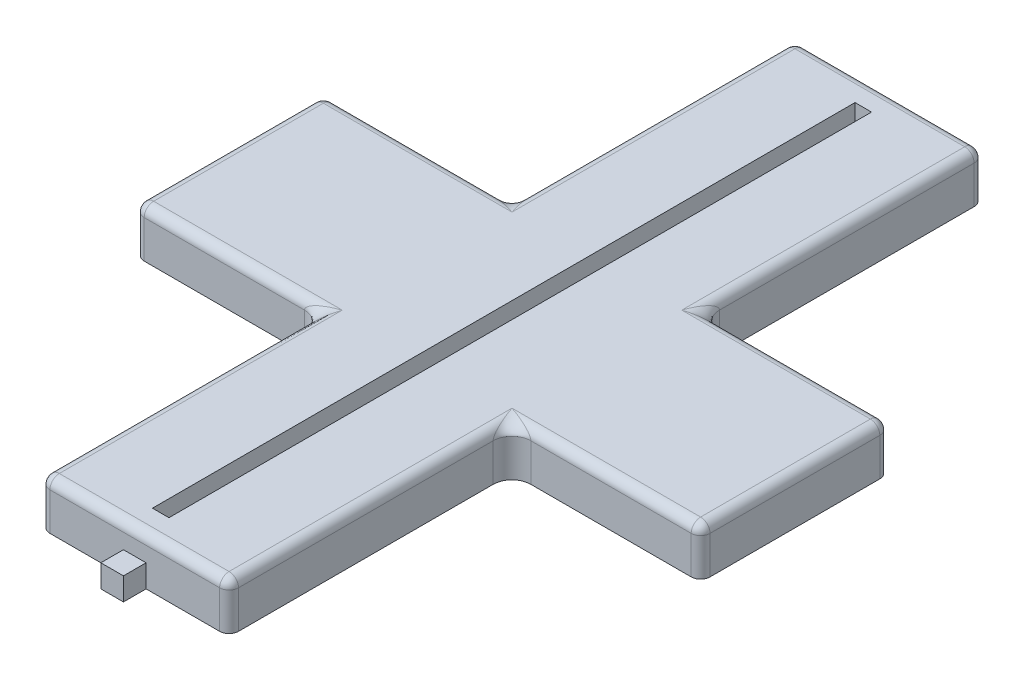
ISO-10303-21;
HEADER;
FILE_DESCRIPTION(('STEP AP214'),'2;1');
FILE_NAME('part.step','',(''),(''),'','','');
FILE_SCHEMA(('AUTOMOTIVE_DESIGN { 1 0 10303 214 1 1 1 1 }'));
ENDSEC;
DATA;
#1=APPLICATION_CONTEXT('core data for automotive mechanical design processes');
#2=APPLICATION_PROTOCOL_DEFINITION('international standard','automotive_design',2000,#1);
#3=PRODUCT_CONTEXT('',#1,'mechanical');
#4=PRODUCT('Part','Part','',(#3));
#5=PRODUCT_RELATED_PRODUCT_CATEGORY('part','',(#4));
#6=PRODUCT_DEFINITION_FORMATION('','',#4);
#7=PRODUCT_DEFINITION_CONTEXT('part definition',#1,'design');
#8=PRODUCT_DEFINITION('design','',#6,#7);
#9=PRODUCT_DEFINITION_SHAPE('','',#8);
#10=(LENGTH_UNIT() NAMED_UNIT(*) SI_UNIT(.MILLI.,.METRE.));
#11=(NAMED_UNIT(*) PLANE_ANGLE_UNIT() SI_UNIT($,.RADIAN.));
#12=(NAMED_UNIT(*) SI_UNIT($,.STERADIAN.) SOLID_ANGLE_UNIT());
#13=UNCERTAINTY_MEASURE_WITH_UNIT(LENGTH_MEASURE(1.E-05),#10,'distance_accuracy_value','');
#14=(GEOMETRIC_REPRESENTATION_CONTEXT(3) GLOBAL_UNCERTAINTY_ASSIGNED_CONTEXT((#13)) GLOBAL_UNIT_ASSIGNED_CONTEXT((#10,
#11,#12)) REPRESENTATION_CONTEXT('',''));
#15=CARTESIAN_POINT('',(0.,0.,0.));
#16=DIRECTION('',(0.,0.,1.));
#17=DIRECTION('',(1.,0.,0.));
#18=AXIS2_PLACEMENT_3D('',#15,#16,#17);
#19=CARTESIAN_POINT('',(-25.4,12.7,-101.6));
#20=DIRECTION('',(1.,0.,0.));
#21=DIRECTION('',(0.,0.,-1.));
#22=AXIS2_PLACEMENT_3D('',#19,#20,#21);
#23=PLANE('',#22);
#24=DIRECTION('',(0.,0.,1.));
#25=VECTOR('',#24,1.);
#26=CARTESIAN_POINT('',(-25.4,0.,-101.6));
#27=LINE('',#26,#25);
#28=CARTESIAN_POINT('',(-25.4,0.,-99.06));
#29=VERTEX_POINT('',#28);
#30=CARTESIAN_POINT('',(-25.4,0.,-30.48));
#31=VERTEX_POINT('',#30);
#32=EDGE_CURVE('E348',#29,#31,#27,.T.);
#33=ORIENTED_EDGE('',*,*,#32,.T.);
#34=DIRECTION('',(0.,1.,0.));
#35=VECTOR('',#34,1.);
#36=CARTESIAN_POINT('',(-25.4,12.7,-30.48));
#37=LINE('',#36,#35);
#38=CARTESIAN_POINT('',(-25.4,10.16,-30.48));
#39=VERTEX_POINT('',#38);
#40=EDGE_CURVE('E571',#31,#39,#37,.T.);
#41=ORIENTED_EDGE('',*,*,#40,.T.);
#42=DIRECTION('',(0.,0.,1.));
#43=VECTOR('',#42,1.);
#44=CARTESIAN_POINT('',(-25.4,10.16,-101.6));
#45=LINE('',#44,#43);
#46=CARTESIAN_POINT('',(-25.4,10.16,-99.06));
#47=VERTEX_POINT('',#46);
#48=EDGE_CURVE('E428',#39,#47,#45,.F.);
#49=ORIENTED_EDGE('',*,*,#48,.T.);
#50=DIRECTION('',(0.,-1.,0.));
#51=VECTOR('',#50,1.);
#52=CARTESIAN_POINT('',(-25.4,12.7,-99.06));
#53=LINE('',#52,#51);
#54=EDGE_CURVE('E426',#47,#29,#53,.T.);
#55=ORIENTED_EDGE('',*,*,#54,.T.);
#56=EDGE_LOOP('',(#33,#41,#49,#55));
#57=FACE_BOUND('',#56,.T.);
#58=ADVANCED_FACE('F37',(#57),#23,.F.);
#59=CARTESIAN_POINT('',(25.4,12.7,-101.6));
#60=DIRECTION('',(-1.,0.,0.));
#61=DIRECTION('',(0.,0.,1.));
#62=AXIS2_PLACEMENT_3D('',#59,#60,#61);
#63=PLANE('',#62);
#64=DIRECTION('',(0.,0.,-1.));
#65=VECTOR('',#64,1.);
#66=CARTESIAN_POINT('',(25.4,10.16,-101.6));
#67=LINE('',#66,#65);
#68=CARTESIAN_POINT('',(25.4,10.16,-99.06));
#69=VERTEX_POINT('',#68);
#70=CARTESIAN_POINT('',(25.4,10.16,-30.48));
#71=VERTEX_POINT('',#70);
#72=EDGE_CURVE('E417',#69,#71,#67,.F.);
#73=ORIENTED_EDGE('',*,*,#72,.T.);
#74=DIRECTION('',(0.,1.,0.));
#75=VECTOR('',#74,1.);
#76=CARTESIAN_POINT('',(25.4,0.,-30.48));
#77=LINE('',#76,#75);
#78=CARTESIAN_POINT('',(25.4,0.,-30.48));
#79=VERTEX_POINT('',#78);
#80=EDGE_CURVE('E569',#71,#79,#77,.F.);
#81=ORIENTED_EDGE('',*,*,#80,.T.);
#82=DIRECTION('',(0.,0.,-1.));
#83=VECTOR('',#82,1.);
#84=CARTESIAN_POINT('',(25.4,0.,-101.6));
#85=LINE('',#84,#83);
#86=CARTESIAN_POINT('',(25.4,0.,-99.06));
#87=VERTEX_POINT('',#86);
#88=EDGE_CURVE('E353',#79,#87,#85,.T.);
#89=ORIENTED_EDGE('',*,*,#88,.T.);
#90=DIRECTION('',(0.,-1.,0.));
#91=VECTOR('',#90,1.);
#92=CARTESIAN_POINT('',(25.4,12.7,-99.06));
#93=LINE('',#92,#91);
#94=EDGE_CURVE('E415',#87,#69,#93,.F.);
#95=ORIENTED_EDGE('',*,*,#94,.T.);
#96=EDGE_LOOP('',(#73,#81,#89,#95));
#97=FACE_BOUND('',#96,.T.);
#98=ADVANCED_FACE('F639',(#97),#63,.F.);
#99=CARTESIAN_POINT('',(25.4,0.,99.06));
#100=VERTEX_POINT('',#99);
#101=CARTESIAN_POINT('',(25.4,0.,30.48));
#102=VERTEX_POINT('',#101);
#103=EDGE_CURVE('E354',#100,#102,#85,.T.);
#104=ORIENTED_EDGE('',*,*,#103,.T.);
#105=DIRECTION('',(0.,-1.,0.));
#106=VECTOR('',#105,1.);
#107=CARTESIAN_POINT('',(25.4,10.16,30.48));
#108=LINE('',#107,#106);
#109=CARTESIAN_POINT('',(25.4,10.16,30.48));
#110=VERTEX_POINT('',#109);
#111=EDGE_CURVE('E565',#102,#110,#108,.F.);
#112=ORIENTED_EDGE('',*,*,#111,.T.);
#113=DIRECTION('',(0.,0.,-1.));
#114=VECTOR('',#113,1.);
#115=CARTESIAN_POINT('',(25.4,10.16,-101.6));
#116=LINE('',#115,#114);
#117=CARTESIAN_POINT('',(25.4,10.16,99.06));
#118=VERTEX_POINT('',#117);
#119=EDGE_CURVE('E404',#110,#118,#116,.F.);
#120=ORIENTED_EDGE('',*,*,#119,.T.);
#121=DIRECTION('',(0.,-1.,0.));
#122=VECTOR('',#121,1.);
#123=CARTESIAN_POINT('',(25.4,12.7,99.06));
#124=LINE('',#123,#122);
#125=EDGE_CURVE('E402',#118,#100,#124,.T.);
#126=ORIENTED_EDGE('',*,*,#125,.T.);
#127=EDGE_LOOP('',(#104,#112,#120,#126));
#128=FACE_BOUND('',#127,.T.);
#129=ADVANCED_FACE('F646',(#128),#63,.F.);
#130=CARTESIAN_POINT('',(25.4,12.7,101.6));
#131=DIRECTION('',(0.,0.,-1.));
#132=DIRECTION('',(-1.,0.,0.));
#133=AXIS2_PLACEMENT_3D('',#130,#131,#132);
#134=PLANE('',#133);
#135=DIRECTION('',(1.,0.,0.));
#136=VECTOR('',#135,1.);
#137=CARTESIAN_POINT('',(25.4,10.16,101.6));
#138=LINE('',#137,#136);
#139=CARTESIAN_POINT('',(22.86,10.16,101.6));
#140=VERTEX_POINT('',#139);
#141=CARTESIAN_POINT('',(-22.86,10.16,101.6));
#142=VERTEX_POINT('',#141);
#143=EDGE_CURVE('E445',#140,#142,#138,.F.);
#144=ORIENTED_EDGE('',*,*,#143,.T.);
#145=DIRECTION('',(0.,-1.,0.));
#146=VECTOR('',#145,1.);
#147=CARTESIAN_POINT('',(-22.86,12.7,101.6));
#148=LINE('',#147,#146);
#149=CARTESIAN_POINT('',(-22.86,0.,101.6));
#150=VERTEX_POINT('',#149);
#151=EDGE_CURVE('E447',#142,#150,#148,.T.);
#152=ORIENTED_EDGE('',*,*,#151,.T.);
#153=DIRECTION('',(1.,0.,0.));
#154=VECTOR('',#153,1.);
#155=CARTESIAN_POINT('',(25.4,0.,101.6));
#156=LINE('',#155,#154);
#157=CARTESIAN_POINT('',(-3.048,0.,101.6));
#158=VERTEX_POINT('',#157);
#159=EDGE_CURVE('E351',#150,#158,#156,.T.);
#160=ORIENTED_EDGE('',*,*,#159,.T.);
#161=DIRECTION('',(0.,-1.,0.));
#162=VECTOR('',#161,1.);
#163=CARTESIAN_POINT('',(-3.048,6.096,101.6));
#164=LINE('',#163,#162);
#165=CARTESIAN_POINT('',(-3.048,6.096,101.6));
#166=VERTEX_POINT('',#165);
#167=EDGE_CURVE('E306',#166,#158,#164,.T.);
#168=ORIENTED_EDGE('',*,*,#167,.F.);
#169=DIRECTION('',(-1.,0.,0.));
#170=VECTOR('',#169,1.);
#171=CARTESIAN_POINT('',(-3.048,6.096,101.6));
#172=LINE('',#171,#170);
#173=CARTESIAN_POINT('',(3.048,6.096,101.6));
#174=VERTEX_POINT('',#173);
#175=EDGE_CURVE('E873',#174,#166,#172,.T.);
#176=ORIENTED_EDGE('',*,*,#175,.F.);
#177=DIRECTION('',(0.,1.,0.));
#178=VECTOR('',#177,1.);
#179=CARTESIAN_POINT('',(3.048,6.096,101.6));
#180=LINE('',#179,#178);
#181=CARTESIAN_POINT('',(3.048,0.,101.6));
#182=VERTEX_POINT('',#181);
#183=EDGE_CURVE('E309',#182,#174,#180,.T.);
#184=ORIENTED_EDGE('',*,*,#183,.F.);
#185=CARTESIAN_POINT('',(22.86,0.,101.6));
#186=VERTEX_POINT('',#185);
#187=EDGE_CURVE('E350',#182,#186,#156,.T.);
#188=ORIENTED_EDGE('',*,*,#187,.T.);
#189=DIRECTION('',(0.,-1.,0.));
#190=VECTOR('',#189,1.);
#191=CARTESIAN_POINT('',(22.86,12.7,101.6));
#192=LINE('',#191,#190);
#193=EDGE_CURVE('E443',#186,#140,#192,.F.);
#194=ORIENTED_EDGE('',*,*,#193,.T.);
#195=EDGE_LOOP('',(#144,#152,#160,#168,#176,#184,#188,#194));
#196=FACE_BOUND('',#195,.T.);
#197=ADVANCED_FACE('F653',(#196),#134,.F.);
#198=DIRECTION('',(0.,0.,1.));
#199=VECTOR('',#198,1.);
#200=CARTESIAN_POINT('',(-25.4,10.16,-101.6));
#201=LINE('',#200,#199);
#202=CARTESIAN_POINT('',(-25.4,10.16,99.06));
#203=VERTEX_POINT('',#202);
#204=CARTESIAN_POINT('',(-25.4,10.16,30.48));
#205=VERTEX_POINT('',#204);
#206=EDGE_CURVE('E440',#203,#205,#201,.F.);
#207=ORIENTED_EDGE('',*,*,#206,.T.);
#208=DIRECTION('',(0.,-1.,0.));
#209=VECTOR('',#208,1.);
#210=CARTESIAN_POINT('',(-25.4,12.7,30.48));
#211=LINE('',#210,#209);
#212=CARTESIAN_POINT('',(-25.4,0.,30.48));
#213=VERTEX_POINT('',#212);
#214=EDGE_CURVE('E559',#205,#213,#211,.T.);
#215=ORIENTED_EDGE('',*,*,#214,.T.);
#216=CARTESIAN_POINT('',(-25.4,0.,99.06));
#217=VERTEX_POINT('',#216);
#218=EDGE_CURVE('E341',#213,#217,#27,.T.);
#219=ORIENTED_EDGE('',*,*,#218,.T.);
#220=DIRECTION('',(0.,-1.,0.));
#221=VECTOR('',#220,1.);
#222=CARTESIAN_POINT('',(-25.4,12.7,99.06));
#223=LINE('',#222,#221);
#224=EDGE_CURVE('E438',#217,#203,#223,.F.);
#225=ORIENTED_EDGE('',*,*,#224,.T.);
#226=EDGE_LOOP('',(#207,#215,#219,#225));
#227=FACE_BOUND('',#226,.T.);
#228=ADVANCED_FACE('F642',(#227),#23,.F.);
#229=CARTESIAN_POINT('',(25.4,12.7,-101.6));
#230=DIRECTION('',(0.,0.,1.));
#231=DIRECTION('',(1.,0.,0.));
#232=AXIS2_PLACEMENT_3D('',#229,#230,#231);
#233=PLANE('',#232);
#234=DIRECTION('',(-1.,0.,0.));
#235=VECTOR('',#234,1.);
#236=CARTESIAN_POINT('',(25.4,10.16,-101.6));
#237=LINE('',#236,#235);
#238=CARTESIAN_POINT('',(-22.86,10.16,-101.6));
#239=VERTEX_POINT('',#238);
#240=CARTESIAN_POINT('',(22.86,10.16,-101.6));
#241=VERTEX_POINT('',#240);
#242=EDGE_CURVE('E422',#239,#241,#237,.F.);
#243=ORIENTED_EDGE('',*,*,#242,.T.);
#244=DIRECTION('',(0.,-1.,0.));
#245=VECTOR('',#244,1.);
#246=CARTESIAN_POINT('',(22.86,12.7,-101.6));
#247=LINE('',#246,#245);
#248=CARTESIAN_POINT('',(22.86,0.,-101.6));
#249=VERTEX_POINT('',#248);
#250=EDGE_CURVE('E424',#241,#249,#247,.T.);
#251=ORIENTED_EDGE('',*,*,#250,.T.);
#252=DIRECTION('',(-1.,0.,0.));
#253=VECTOR('',#252,1.);
#254=CARTESIAN_POINT('',(25.4,0.,-101.6));
#255=LINE('',#254,#253);
#256=CARTESIAN_POINT('',(-22.86,0.,-101.6));
#257=VERTEX_POINT('',#256);
#258=EDGE_CURVE('E357',#249,#257,#255,.T.);
#259=ORIENTED_EDGE('',*,*,#258,.T.);
#260=DIRECTION('',(0.,-1.,0.));
#261=VECTOR('',#260,1.);
#262=CARTESIAN_POINT('',(-22.86,12.7,-101.6));
#263=LINE('',#262,#261);
#264=EDGE_CURVE('E420',#257,#239,#263,.F.);
#265=ORIENTED_EDGE('',*,*,#264,.T.);
#266=EDGE_LOOP('',(#243,#251,#259,#265));
#267=FACE_BOUND('',#266,.T.);
#268=ADVANCED_FACE('F652',(#267),#233,.F.);
#269=CARTESIAN_POINT('',(0.,12.7,0.));
#270=DIRECTION('',(0.,-1.,0.));
#271=DIRECTION('',(0.,0.,-1.));
#272=AXIS2_PLACEMENT_3D('',#269,#270,#271);
#273=PLANE('',#272);
#274=DIRECTION('',(-1.,0.,0.));
#275=VECTOR('',#274,1.);
#276=CARTESIAN_POINT('',(0.,12.7,22.86));
#277=LINE('',#276,#275);
#278=CARTESIAN_POINT('',(22.86,12.7,22.86));
#279=VERTEX_POINT('',#278);
#280=CARTESIAN_POINT('',(73.66,12.7,22.86));
#281=VERTEX_POINT('',#280);
#282=EDGE_CURVE('E385',#279,#281,#277,.F.);
#283=ORIENTED_EDGE('',*,*,#282,.T.);
#284=DIRECTION('',(0.,0.,1.));
#285=VECTOR('',#284,1.);
#286=CARTESIAN_POINT('',(73.66,12.7,-25.4));
#287=LINE('',#286,#285);
#288=CARTESIAN_POINT('',(73.66,12.7,-22.86));
#289=VERTEX_POINT('',#288);
#290=EDGE_CURVE('E387',#281,#289,#287,.F.);
#291=ORIENTED_EDGE('',*,*,#290,.T.);
#292=DIRECTION('',(-1.,0.,0.));
#293=VECTOR('',#292,1.);
#294=CARTESIAN_POINT('',(0.,12.7,-22.86));
#295=LINE('',#294,#293);
#296=CARTESIAN_POINT('',(22.86,12.7,-22.86));
#297=VERTEX_POINT('',#296);
#298=EDGE_CURVE('E382',#289,#297,#295,.T.);
#299=ORIENTED_EDGE('',*,*,#298,.T.);
#300=DIRECTION('',(0.,0.,-1.));
#301=VECTOR('',#300,1.);
#302=CARTESIAN_POINT('',(22.86,12.7,0.));
#303=LINE('',#302,#301);
#304=CARTESIAN_POINT('',(22.86,12.7,-99.06));
#305=VERTEX_POINT('',#304);
#306=EDGE_CURVE('E380',#297,#305,#303,.T.);
#307=ORIENTED_EDGE('',*,*,#306,.T.);
#308=DIRECTION('',(-1.,0.,0.));
#309=VECTOR('',#308,1.);
#310=CARTESIAN_POINT('',(0.,12.7,-99.06));
#311=LINE('',#310,#309);
#312=CARTESIAN_POINT('',(-22.86,12.7,-99.06));
#313=VERTEX_POINT('',#312);
#314=EDGE_CURVE('E378',#305,#313,#311,.T.);
#315=ORIENTED_EDGE('',*,*,#314,.T.);
#316=DIRECTION('',(0.,0.,1.));
#317=VECTOR('',#316,1.);
#318=CARTESIAN_POINT('',(-22.86,12.7,0.));
#319=LINE('',#318,#317);
#320=CARTESIAN_POINT('',(-22.86,12.7,-22.86));
#321=VERTEX_POINT('',#320);
#322=EDGE_CURVE('E375',#313,#321,#319,.T.);
#323=ORIENTED_EDGE('',*,*,#322,.T.);
#324=DIRECTION('',(1.,0.,0.));
#325=VECTOR('',#324,1.);
#326=CARTESIAN_POINT('',(-76.2,12.7,-22.86));
#327=LINE('',#326,#325);
#328=CARTESIAN_POINT('',(-73.66,12.7,-22.86));
#329=VERTEX_POINT('',#328);
#330=EDGE_CURVE('E373',#321,#329,#327,.F.);
#331=ORIENTED_EDGE('',*,*,#330,.T.);
#332=DIRECTION('',(0.,0.,1.));
#333=VECTOR('',#332,1.);
#334=CARTESIAN_POINT('',(-73.66,12.7,25.4));
#335=LINE('',#334,#333);
#336=CARTESIAN_POINT('',(-73.66,12.7,22.86));
#337=VERTEX_POINT('',#336);
#338=EDGE_CURVE('E370',#329,#337,#335,.T.);
#339=ORIENTED_EDGE('',*,*,#338,.T.);
#340=DIRECTION('',(1.,0.,0.));
#341=VECTOR('',#340,1.);
#342=CARTESIAN_POINT('',(-25.4,12.7,22.86));
#343=LINE('',#342,#341);
#344=CARTESIAN_POINT('',(-22.86,12.7,22.86));
#345=VERTEX_POINT('',#344);
#346=EDGE_CURVE('E364',#337,#345,#343,.T.);
#347=ORIENTED_EDGE('',*,*,#346,.T.);
#348=DIRECTION('',(0.,0.,1.));
#349=VECTOR('',#348,1.);
#350=CARTESIAN_POINT('',(-22.86,12.7,0.));
#351=LINE('',#350,#349);
#352=CARTESIAN_POINT('',(-22.86,12.7,99.06));
#353=VERTEX_POINT('',#352);
#354=EDGE_CURVE('E362',#345,#353,#351,.T.);
#355=ORIENTED_EDGE('',*,*,#354,.T.);
#356=DIRECTION('',(1.,0.,0.));
#357=VECTOR('',#356,1.);
#358=CARTESIAN_POINT('',(0.,12.7,99.06));
#359=LINE('',#358,#357);
#360=CARTESIAN_POINT('',(22.86,12.7,99.06));
#361=VERTEX_POINT('',#360);
#362=EDGE_CURVE('E360',#353,#361,#359,.T.);
#363=ORIENTED_EDGE('',*,*,#362,.T.);
#364=DIRECTION('',(0.,0.,-1.));
#365=VECTOR('',#364,1.);
#366=CARTESIAN_POINT('',(22.86,12.7,0.));
#367=LINE('',#366,#365);
#368=EDGE_CURVE('E367',#361,#279,#367,.T.);
#369=ORIENTED_EDGE('',*,*,#368,.T.);
#370=EDGE_LOOP('',(#283,#291,#299,#307,#315,#323,#331,#339,#347,#355,#363,#369));
#371=FACE_BOUND('',#370,.T.);
#372=DIRECTION('',(1.,0.,0.));
#373=VECTOR('',#372,1.);
#374=CARTESIAN_POINT('',(2.22250000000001,12.7,94.6109449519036));
#375=LINE('',#374,#373);
#376=CARTESIAN_POINT('',(-2.22249999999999,12.7,94.6109449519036));
#377=VERTEX_POINT('',#376);
#378=CARTESIAN_POINT('',(2.22250000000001,12.7,94.6109449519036));
#379=VERTEX_POINT('',#378);
#380=EDGE_CURVE('E312',#377,#379,#375,.T.);
#381=ORIENTED_EDGE('',*,*,#380,.F.);
#382=DIRECTION('',(0.,0.,1.));
#383=VECTOR('',#382,1.);
#384=CARTESIAN_POINT('',(-2.22250000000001,12.7,-94.6109449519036));
#385=LINE('',#384,#383);
#386=CARTESIAN_POINT('',(-2.22250000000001,12.7,-94.6109449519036));
#387=VERTEX_POINT('',#386);
#388=EDGE_CURVE('E310',#387,#377,#385,.T.);
#389=ORIENTED_EDGE('',*,*,#388,.F.);
#390=DIRECTION('',(-1.,0.,0.));
#391=VECTOR('',#390,1.);
#392=CARTESIAN_POINT('',(2.22249999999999,12.7,-94.6109449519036));
#393=LINE('',#392,#391);
#394=CARTESIAN_POINT('',(2.22249999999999,12.7,-94.6109449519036));
#395=VERTEX_POINT('',#394);
#396=EDGE_CURVE('E322',#395,#387,#393,.T.);
#397=ORIENTED_EDGE('',*,*,#396,.F.);
#398=DIRECTION('',(0.,0.,-1.));
#399=VECTOR('',#398,1.);
#400=CARTESIAN_POINT('',(2.22249999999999,12.7,-94.6109449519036));
#401=LINE('',#400,#399);
#402=EDGE_CURVE('E334',#379,#395,#401,.T.);
#403=ORIENTED_EDGE('',*,*,#402,.F.);
#404=EDGE_LOOP('',(#381,#389,#397,#403));
#405=FACE_BOUND('',#404,.T.);
#406=ADVANCED_FACE('F659',(#371,#405),#273,.F.);
#407=CARTESIAN_POINT('',(0.,0.,0.));
#408=DIRECTION('',(0.,-1.,0.));
#409=DIRECTION('',(0.,0.,-1.));
#410=AXIS2_PLACEMENT_3D('',#407,#408,#409);
#411=PLANE('',#410);
#412=ORIENTED_EDGE('',*,*,#258,.F.);
#413=CARTESIAN_POINT('',(22.86,0.,-99.06));
#414=DIRECTION('',(0.,-1.,0.));
#415=DIRECTION('',(0.,0.,-1.));
#416=AXIS2_PLACEMENT_3D('',#413,#414,#415);
#417=CIRCLE('',#416,2.54);
#418=EDGE_CURVE('E464',#249,#87,#417,.T.);
#419=ORIENTED_EDGE('',*,*,#418,.T.);
#420=ORIENTED_EDGE('',*,*,#88,.F.);
#421=CARTESIAN_POINT('',(30.48,0.,-30.48));
#422=DIRECTION('',(0.,-1.,0.));
#423=DIRECTION('',(0.,0.,-1.));
#424=AXIS2_PLACEMENT_3D('',#421,#422,#423);
#425=CIRCLE('',#424,5.08);
#426=CARTESIAN_POINT('',(30.48,0.,-25.4));
#427=VERTEX_POINT('',#426);
#428=EDGE_CURVE('E46',#79,#427,#425,.F.);
#429=ORIENTED_EDGE('',*,*,#428,.T.);
#430=DIRECTION('',(-1.,0.,0.));
#431=VECTOR('',#430,1.);
#432=CARTESIAN_POINT('',(76.2,0.,-25.4));
#433=LINE('',#432,#431);
#434=CARTESIAN_POINT('',(73.66,0.,-25.4));
#435=VERTEX_POINT('',#434);
#436=EDGE_CURVE('E858',#435,#427,#433,.T.);
#437=ORIENTED_EDGE('',*,*,#436,.F.);
#438=CARTESIAN_POINT('',(73.66,0.,-22.86));
#439=DIRECTION('',(0.,-1.,0.));
#440=DIRECTION('',(0.,0.,-1.));
#441=AXIS2_PLACEMENT_3D('',#438,#439,#440);
#442=CIRCLE('',#441,2.54);
#443=CARTESIAN_POINT('',(76.2,0.,-22.86));
#444=VERTEX_POINT('',#443);
#445=EDGE_CURVE('E449',#435,#444,#442,.T.);
#446=ORIENTED_EDGE('',*,*,#445,.T.);
#447=DIRECTION('',(0.,0.,-1.));
#448=VECTOR('',#447,1.);
#449=CARTESIAN_POINT('',(76.2,0.,25.4));
#450=LINE('',#449,#448);
#451=CARTESIAN_POINT('',(76.2,0.,22.86));
#452=VERTEX_POINT('',#451);
#453=EDGE_CURVE('E857',#452,#444,#450,.T.);
#454=ORIENTED_EDGE('',*,*,#453,.F.);
#455=CARTESIAN_POINT('',(73.66,0.,22.86));
#456=DIRECTION('',(0.,-1.,0.));
#457=DIRECTION('',(0.,0.,-1.));
#458=AXIS2_PLACEMENT_3D('',#455,#456,#457);
#459=CIRCLE('',#458,2.54);
#460=CARTESIAN_POINT('',(73.66,0.,25.4));
#461=VERTEX_POINT('',#460);
#462=EDGE_CURVE('E451',#452,#461,#459,.T.);
#463=ORIENTED_EDGE('',*,*,#462,.T.);
#464=DIRECTION('',(-1.,0.,0.));
#465=VECTOR('',#464,1.);
#466=CARTESIAN_POINT('',(76.2,0.,25.4));
#467=LINE('',#466,#465);
#468=CARTESIAN_POINT('',(30.48,0.,25.4));
#469=VERTEX_POINT('',#468);
#470=EDGE_CURVE('E713',#461,#469,#467,.T.);
#471=ORIENTED_EDGE('',*,*,#470,.T.);
#472=CARTESIAN_POINT('',(30.48,0.,30.48));
#473=DIRECTION('',(0.,-1.,0.));
#474=DIRECTION('',(0.,0.,-1.));
#475=AXIS2_PLACEMENT_3D('',#472,#473,#474);
#476=CIRCLE('',#475,5.08);
#477=EDGE_CURVE('E576',#469,#102,#476,.F.);
#478=ORIENTED_EDGE('',*,*,#477,.T.);
#479=ORIENTED_EDGE('',*,*,#103,.F.);
#480=CARTESIAN_POINT('',(22.86,0.,99.06));
#481=DIRECTION('',(0.,-1.,0.));
#482=DIRECTION('',(0.,0.,-1.));
#483=AXIS2_PLACEMENT_3D('',#480,#481,#482);
#484=CIRCLE('',#483,2.54);
#485=EDGE_CURVE('E453',#100,#186,#484,.T.);
#486=ORIENTED_EDGE('',*,*,#485,.T.);
#487=ORIENTED_EDGE('',*,*,#187,.F.);
#488=DIRECTION('',(0.,0.,-1.));
#489=VECTOR('',#488,1.);
#490=CARTESIAN_POINT('',(3.048,0.,107.696));
#491=LINE('',#490,#489);
#492=CARTESIAN_POINT('',(3.048,0.,107.696));
#493=VERTEX_POINT('',#492);
#494=EDGE_CURVE('E871',#493,#182,#491,.T.);
#495=ORIENTED_EDGE('',*,*,#494,.F.);
#496=DIRECTION('',(1.,0.,0.));
#497=VECTOR('',#496,1.);
#498=CARTESIAN_POINT('',(-3.048,0.,107.696));
#499=LINE('',#498,#497);
#500=CARTESIAN_POINT('',(-3.048,0.,107.696));
#501=VERTEX_POINT('',#500);
#502=EDGE_CURVE('E302',#501,#493,#499,.T.);
#503=ORIENTED_EDGE('',*,*,#502,.F.);
#504=DIRECTION('',(0.,0.,-1.));
#505=VECTOR('',#504,1.);
#506=CARTESIAN_POINT('',(-3.048,0.,107.696));
#507=LINE('',#506,#505);
#508=EDGE_CURVE('E314',#501,#158,#507,.T.);
#509=ORIENTED_EDGE('',*,*,#508,.T.);
#510=ORIENTED_EDGE('',*,*,#159,.F.);
#511=CARTESIAN_POINT('',(-22.86,0.,99.06));
#512=DIRECTION('',(0.,-1.,0.));
#513=DIRECTION('',(0.,0.,-1.));
#514=AXIS2_PLACEMENT_3D('',#511,#512,#513);
#515=CIRCLE('',#514,2.54);
#516=EDGE_CURVE('E455',#150,#217,#515,.T.);
#517=ORIENTED_EDGE('',*,*,#516,.T.);
#518=ORIENTED_EDGE('',*,*,#218,.F.);
#519=CARTESIAN_POINT('',(-30.48,0.,30.48));
#520=DIRECTION('',(0.,-1.,0.));
#521=DIRECTION('',(0.,0.,-1.));
#522=AXIS2_PLACEMENT_3D('',#519,#520,#521);
#523=CIRCLE('',#522,5.08);
#524=CARTESIAN_POINT('',(-30.48,0.,25.4));
#525=VERTEX_POINT('',#524);
#526=EDGE_CURVE('E574',#213,#525,#523,.F.);
#527=ORIENTED_EDGE('',*,*,#526,.T.);
#528=DIRECTION('',(1.,0.,0.));
#529=VECTOR('',#528,1.);
#530=CARTESIAN_POINT('',(-76.2,0.,25.4));
#531=LINE('',#530,#529);
#532=CARTESIAN_POINT('',(-73.66,0.,25.4));
#533=VERTEX_POINT('',#532);
#534=EDGE_CURVE('E864',#533,#525,#531,.T.);
#535=ORIENTED_EDGE('',*,*,#534,.F.);
#536=CARTESIAN_POINT('',(-73.66,0.,22.86));
#537=DIRECTION('',(0.,-1.,0.));
#538=DIRECTION('',(0.,0.,-1.));
#539=AXIS2_PLACEMENT_3D('',#536,#537,#538);
#540=CIRCLE('',#539,2.54);
#541=CARTESIAN_POINT('',(-76.2,0.,22.86));
#542=VERTEX_POINT('',#541);
#543=EDGE_CURVE('E458',#533,#542,#540,.T.);
#544=ORIENTED_EDGE('',*,*,#543,.T.);
#545=DIRECTION('',(0.,0.,-1.));
#546=VECTOR('',#545,1.);
#547=CARTESIAN_POINT('',(-76.2,0.,25.4));
#548=LINE('',#547,#546);
#549=CARTESIAN_POINT('',(-76.2,0.,-22.86));
#550=VERTEX_POINT('',#549);
#551=EDGE_CURVE('E539',#542,#550,#548,.T.);
#552=ORIENTED_EDGE('',*,*,#551,.T.);
#553=CARTESIAN_POINT('',(-73.66,0.,-22.86));
#554=DIRECTION('',(0.,-1.,0.));
#555=DIRECTION('',(0.,0.,-1.));
#556=AXIS2_PLACEMENT_3D('',#553,#554,#555);
#557=CIRCLE('',#556,2.54);
#558=CARTESIAN_POINT('',(-73.66,0.,-25.4));
#559=VERTEX_POINT('',#558);
#560=EDGE_CURVE('E460',#550,#559,#557,.T.);
#561=ORIENTED_EDGE('',*,*,#560,.T.);
#562=DIRECTION('',(1.,0.,0.));
#563=VECTOR('',#562,1.);
#564=CARTESIAN_POINT('',(-76.2,0.,-25.4));
#565=LINE('',#564,#563);
#566=CARTESIAN_POINT('',(-30.48,0.,-25.4));
#567=VERTEX_POINT('',#566);
#568=EDGE_CURVE('E861',#559,#567,#565,.T.);
#569=ORIENTED_EDGE('',*,*,#568,.T.);
#570=CARTESIAN_POINT('',(-30.48,0.,-30.48));
#571=DIRECTION('',(0.,-1.,0.));
#572=DIRECTION('',(0.,0.,-1.));
#573=AXIS2_PLACEMENT_3D('',#570,#571,#572);
#574=CIRCLE('',#573,5.08);
#575=EDGE_CURVE('E11',#567,#31,#574,.F.);
#576=ORIENTED_EDGE('',*,*,#575,.T.);
#577=ORIENTED_EDGE('',*,*,#32,.F.);
#578=CARTESIAN_POINT('',(-22.86,0.,-99.06));
#579=DIRECTION('',(0.,-1.,0.));
#580=DIRECTION('',(0.,0.,-1.));
#581=AXIS2_PLACEMENT_3D('',#578,#579,#580);
#582=CIRCLE('',#581,2.54);
#583=EDGE_CURVE('E462',#29,#257,#582,.T.);
#584=ORIENTED_EDGE('',*,*,#583,.T.);
#585=EDGE_LOOP('',(#412,#419,#420,#429,#437,#446,#454,#463,#471,#478,#479,#486,#487,#495,#503,
#509,#510,#517,#518,#527,#535,#544,#552,#561,#569,#576,#577,#584));
#586=FACE_BOUND('',#585,.T.);
#587=ADVANCED_FACE('F707',(#586),#411,.T.);
#588=CARTESIAN_POINT('',(-2.22250000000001,6.35,-94.6109449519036));
#589=DIRECTION('',(-1.,0.,0.));
#590=DIRECTION('',(0.,0.,1.));
#591=AXIS2_PLACEMENT_3D('',#588,#589,#590);
#592=PLANE('',#591);
#593=ORIENTED_EDGE('',*,*,#388,.T.);
#594=DIRECTION('',(0.,1.,0.));
#595=VECTOR('',#594,1.);
#596=CARTESIAN_POINT('',(-2.22249999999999,6.35,94.6109449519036));
#597=LINE('',#596,#595);
#598=CARTESIAN_POINT('',(-2.22249999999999,6.35,94.6109449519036));
#599=VERTEX_POINT('',#598);
#600=EDGE_CURVE('E330',#599,#377,#597,.T.);
#601=ORIENTED_EDGE('',*,*,#600,.F.);
#602=DIRECTION('',(0.,0.,1.));
#603=VECTOR('',#602,1.);
#604=CARTESIAN_POINT('',(-2.22250000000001,6.35,-94.6109449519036));
#605=LINE('',#604,#603);
#606=CARTESIAN_POINT('',(-2.22250000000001,6.35,-94.6109449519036));
#607=VERTEX_POINT('',#606);
#608=EDGE_CURVE('E318',#607,#599,#605,.T.);
#609=ORIENTED_EDGE('',*,*,#608,.F.);
#610=DIRECTION('',(0.,1.,0.));
#611=VECTOR('',#610,1.);
#612=CARTESIAN_POINT('',(-2.22250000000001,6.35,-94.6109449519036));
#613=LINE('',#612,#611);
#614=EDGE_CURVE('E339',#607,#387,#613,.T.);
#615=ORIENTED_EDGE('',*,*,#614,.T.);
#616=EDGE_LOOP('',(#593,#601,#609,#615));
#617=FACE_BOUND('',#616,.T.);
#618=ADVANCED_FACE('F932',(#617),#592,.F.);
#619=CARTESIAN_POINT('',(2.22249999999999,6.35,-94.6109449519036));
#620=DIRECTION('',(0.,0.,-1.));
#621=DIRECTION('',(-1.,0.,0.));
#622=AXIS2_PLACEMENT_3D('',#619,#620,#621);
#623=PLANE('',#622);
#624=ORIENTED_EDGE('',*,*,#396,.T.);
#625=ORIENTED_EDGE('',*,*,#614,.F.);
#626=DIRECTION('',(-1.,0.,0.));
#627=VECTOR('',#626,1.);
#628=CARTESIAN_POINT('',(2.22249999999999,6.35,-94.6109449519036));
#629=LINE('',#628,#627);
#630=CARTESIAN_POINT('',(2.22249999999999,6.35,-94.6109449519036));
#631=VERTEX_POINT('',#630);
#632=EDGE_CURVE('E328',#631,#607,#629,.T.);
#633=ORIENTED_EDGE('',*,*,#632,.F.);
#634=DIRECTION('',(0.,1.,0.));
#635=VECTOR('',#634,1.);
#636=CARTESIAN_POINT('',(2.22249999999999,6.35,-94.6109449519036));
#637=LINE('',#636,#635);
#638=EDGE_CURVE('E342',#631,#395,#637,.T.);
#639=ORIENTED_EDGE('',*,*,#638,.T.);
#640=EDGE_LOOP('',(#624,#625,#633,#639));
#641=FACE_BOUND('',#640,.T.);
#642=ADVANCED_FACE('F928',(#641),#623,.F.);
#643=CARTESIAN_POINT('',(2.22249999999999,6.35,-94.6109449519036));
#644=DIRECTION('',(1.,0.,0.));
#645=DIRECTION('',(0.,0.,-1.));
#646=AXIS2_PLACEMENT_3D('',#643,#644,#645);
#647=PLANE('',#646);
#648=ORIENTED_EDGE('',*,*,#402,.T.);
#649=ORIENTED_EDGE('',*,*,#638,.F.);
#650=DIRECTION('',(0.,0.,-1.));
#651=VECTOR('',#650,1.);
#652=CARTESIAN_POINT('',(2.22249999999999,6.35,-94.6109449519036));
#653=LINE('',#652,#651);
#654=CARTESIAN_POINT('',(2.22250000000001,6.35,94.6109449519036));
#655=VERTEX_POINT('',#654);
#656=EDGE_CURVE('E325',#655,#631,#653,.T.);
#657=ORIENTED_EDGE('',*,*,#656,.F.);
#658=DIRECTION('',(0.,1.,0.));
#659=VECTOR('',#658,1.);
#660=CARTESIAN_POINT('',(2.22250000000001,6.35,94.6109449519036));
#661=LINE('',#660,#659);
#662=EDGE_CURVE('E344',#655,#379,#661,.T.);
#663=ORIENTED_EDGE('',*,*,#662,.T.);
#664=EDGE_LOOP('',(#648,#649,#657,#663));
#665=FACE_BOUND('',#664,.T.);
#666=ADVANCED_FACE('F931',(#665),#647,.F.);
#667=CARTESIAN_POINT('',(2.22250000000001,6.35,94.6109449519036));
#668=DIRECTION('',(0.,0.,1.));
#669=DIRECTION('',(1.,0.,0.));
#670=AXIS2_PLACEMENT_3D('',#667,#668,#669);
#671=PLANE('',#670);
#672=ORIENTED_EDGE('',*,*,#380,.T.);
#673=ORIENTED_EDGE('',*,*,#662,.F.);
#674=DIRECTION('',(1.,0.,0.));
#675=VECTOR('',#674,1.);
#676=CARTESIAN_POINT('',(2.22250000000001,6.35,94.6109449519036));
#677=LINE('',#676,#675);
#678=EDGE_CURVE('E321',#599,#655,#677,.T.);
#679=ORIENTED_EDGE('',*,*,#678,.F.);
#680=ORIENTED_EDGE('',*,*,#600,.T.);
#681=EDGE_LOOP('',(#672,#673,#679,#680));
#682=FACE_BOUND('',#681,.T.);
#683=ADVANCED_FACE('F926',(#682),#671,.F.);
#684=CARTESIAN_POINT('',(0.,6.35,0.));
#685=DIRECTION('',(0.,-1.,0.));
#686=DIRECTION('',(0.,0.,-1.));
#687=AXIS2_PLACEMENT_3D('',#684,#685,#686);
#688=PLANE('',#687);
#689=ORIENTED_EDGE('',*,*,#608,.T.);
#690=ORIENTED_EDGE('',*,*,#678,.T.);
#691=ORIENTED_EDGE('',*,*,#656,.T.);
#692=ORIENTED_EDGE('',*,*,#632,.T.);
#693=EDGE_LOOP('',(#689,#690,#691,#692));
#694=FACE_BOUND('',#693,.T.);
#695=ADVANCED_FACE('F923',(#694),#688,.F.);
#696=CARTESIAN_POINT('',(3.048,6.096,107.696));
#697=DIRECTION('',(-1.,0.,0.));
#698=DIRECTION('',(0.,-1.,0.));
#699=AXIS2_PLACEMENT_3D('',#696,#697,#698);
#700=PLANE('',#699);
#701=ORIENTED_EDGE('',*,*,#183,.T.);
#702=DIRECTION('',(0.,0.,-1.));
#703=VECTOR('',#702,1.);
#704=CARTESIAN_POINT('',(3.048,6.096,107.696));
#705=LINE('',#704,#703);
#706=CARTESIAN_POINT('',(3.048,6.096,107.696));
#707=VERTEX_POINT('',#706);
#708=EDGE_CURVE('E290',#707,#174,#705,.T.);
#709=ORIENTED_EDGE('',*,*,#708,.F.);
#710=DIRECTION('',(0.,1.,0.));
#711=VECTOR('',#710,1.);
#712=CARTESIAN_POINT('',(3.048,6.096,107.696));
#713=LINE('',#712,#711);
#714=EDGE_CURVE('E297',#493,#707,#713,.T.);
#715=ORIENTED_EDGE('',*,*,#714,.F.);
#716=ORIENTED_EDGE('',*,*,#494,.T.);
#717=EDGE_LOOP('',(#701,#709,#715,#716));
#718=FACE_BOUND('',#717,.T.);
#719=ADVANCED_FACE('F308',(#718),#700,.F.);
#720=CARTESIAN_POINT('',(-3.048,6.096,107.696));
#721=DIRECTION('',(0.,-1.,0.));
#722=DIRECTION('',(0.,0.,-1.));
#723=AXIS2_PLACEMENT_3D('',#720,#721,#722);
#724=PLANE('',#723);
#725=ORIENTED_EDGE('',*,*,#175,.T.);
#726=DIRECTION('',(0.,0.,-1.));
#727=VECTOR('',#726,1.);
#728=CARTESIAN_POINT('',(-3.048,6.096,107.696));
#729=LINE('',#728,#727);
#730=CARTESIAN_POINT('',(-3.048,6.096,107.696));
#731=VERTEX_POINT('',#730);
#732=EDGE_CURVE('E293',#731,#166,#729,.T.);
#733=ORIENTED_EDGE('',*,*,#732,.F.);
#734=DIRECTION('',(-1.,0.,0.));
#735=VECTOR('',#734,1.);
#736=CARTESIAN_POINT('',(-3.048,6.096,107.696));
#737=LINE('',#736,#735);
#738=EDGE_CURVE('E285',#707,#731,#737,.T.);
#739=ORIENTED_EDGE('',*,*,#738,.F.);
#740=ORIENTED_EDGE('',*,*,#708,.T.);
#741=EDGE_LOOP('',(#725,#733,#739,#740));
#742=FACE_BOUND('',#741,.T.);
#743=ADVANCED_FACE('F288',(#742),#724,.F.);
#744=CARTESIAN_POINT('',(-3.048,6.096,107.696));
#745=DIRECTION('',(1.,0.,0.));
#746=DIRECTION('',(0.,1.,0.));
#747=AXIS2_PLACEMENT_3D('',#744,#745,#746);
#748=PLANE('',#747);
#749=ORIENTED_EDGE('',*,*,#167,.T.);
#750=ORIENTED_EDGE('',*,*,#508,.F.);
#751=DIRECTION('',(0.,-1.,0.));
#752=VECTOR('',#751,1.);
#753=CARTESIAN_POINT('',(-3.048,6.096,107.696));
#754=LINE('',#753,#752);
#755=EDGE_CURVE('E296',#731,#501,#754,.T.);
#756=ORIENTED_EDGE('',*,*,#755,.F.);
#757=ORIENTED_EDGE('',*,*,#732,.T.);
#758=EDGE_LOOP('',(#749,#750,#756,#757));
#759=FACE_BOUND('',#758,.T.);
#760=ADVANCED_FACE('F882',(#759),#748,.F.);
#761=CARTESIAN_POINT('',(0.,0.,107.696));
#762=DIRECTION('',(0.,0.,1.));
#763=DIRECTION('',(1.,0.,0.));
#764=AXIS2_PLACEMENT_3D('',#761,#762,#763);
#765=PLANE('',#764);
#766=ORIENTED_EDGE('',*,*,#714,.T.);
#767=ORIENTED_EDGE('',*,*,#738,.T.);
#768=ORIENTED_EDGE('',*,*,#755,.T.);
#769=ORIENTED_EDGE('',*,*,#502,.T.);
#770=EDGE_LOOP('',(#766,#767,#768,#769));
#771=FACE_BOUND('',#770,.T.);
#772=ADVANCED_FACE('F300',(#771),#765,.T.);
#773=CARTESIAN_POINT('',(76.2,12.7,-25.4));
#774=DIRECTION('',(0.,0.,1.));
#775=DIRECTION('',(1.,0.,0.));
#776=AXIS2_PLACEMENT_3D('',#773,#774,#775);
#777=PLANE('',#776);
#778=ORIENTED_EDGE('',*,*,#436,.T.);
#779=DIRECTION('',(0.,1.,0.));
#780=VECTOR('',#779,1.);
#781=CARTESIAN_POINT('',(30.48,10.16,-25.4));
#782=LINE('',#781,#780);
#783=CARTESIAN_POINT('',(30.48,10.16,-25.4));
#784=VERTEX_POINT('',#783);
#785=EDGE_CURVE('E567',#427,#784,#782,.T.);
#786=ORIENTED_EDGE('',*,*,#785,.T.);
#787=DIRECTION('',(-1.,0.,0.));
#788=VECTOR('',#787,1.);
#789=CARTESIAN_POINT('',(76.2,10.16,-25.4));
#790=LINE('',#789,#788);
#791=CARTESIAN_POINT('',(73.66,10.16,-25.4));
#792=VERTEX_POINT('',#791);
#793=EDGE_CURVE('E413',#784,#792,#790,.F.);
#794=ORIENTED_EDGE('',*,*,#793,.T.);
#795=DIRECTION('',(0.,1.,0.));
#796=VECTOR('',#795,1.);
#797=CARTESIAN_POINT('',(73.66,0.,-25.4));
#798=LINE('',#797,#796);
#799=EDGE_CURVE('E411',#792,#435,#798,.F.);
#800=ORIENTED_EDGE('',*,*,#799,.T.);
#801=EDGE_LOOP('',(#778,#786,#794,#800));
#802=FACE_BOUND('',#801,.T.);
#803=ADVANCED_FACE('F911',(#802),#777,.F.);
#804=CARTESIAN_POINT('',(76.2,12.7,25.4));
#805=DIRECTION('',(0.,0.,-1.));
#806=DIRECTION('',(-1.,0.,0.));
#807=AXIS2_PLACEMENT_3D('',#804,#805,#806);
#808=PLANE('',#807);
#809=DIRECTION('',(-1.,0.,0.));
#810=VECTOR('',#809,1.);
#811=CARTESIAN_POINT('',(76.2,10.16,25.4));
#812=LINE('',#811,#810);
#813=CARTESIAN_POINT('',(73.66,10.16,25.4));
#814=VERTEX_POINT('',#813);
#815=CARTESIAN_POINT('',(30.48,10.16,25.4));
#816=VERTEX_POINT('',#815);
#817=EDGE_CURVE('E408',#814,#816,#812,.T.);
#818=ORIENTED_EDGE('',*,*,#817,.T.);
#819=DIRECTION('',(0.,-1.,0.));
#820=VECTOR('',#819,1.);
#821=CARTESIAN_POINT('',(30.48,0.,25.4));
#822=LINE('',#821,#820);
#823=EDGE_CURVE('E563',#816,#469,#822,.T.);
#824=ORIENTED_EDGE('',*,*,#823,.T.);
#825=ORIENTED_EDGE('',*,*,#470,.F.);
#826=DIRECTION('',(0.,-1.,0.));
#827=VECTOR('',#826,1.);
#828=CARTESIAN_POINT('',(73.66,12.7,25.4));
#829=LINE('',#828,#827);
#830=EDGE_CURVE('E406',#461,#814,#829,.F.);
#831=ORIENTED_EDGE('',*,*,#830,.T.);
#832=EDGE_LOOP('',(#818,#824,#825,#831));
#833=FACE_BOUND('',#832,.T.);
#834=ADVANCED_FACE('F725',(#833),#808,.F.);
#835=CARTESIAN_POINT('',(76.2,0.,0.));
#836=DIRECTION('',(1.,0.,0.));
#837=DIRECTION('',(0.,0.,-1.));
#838=AXIS2_PLACEMENT_3D('',#835,#836,#837);
#839=PLANE('',#838);
#840=DIRECTION('',(0.,0.,1.));
#841=VECTOR('',#840,1.);
#842=CARTESIAN_POINT('',(76.2,10.16,25.4));
#843=LINE('',#842,#841);
#844=CARTESIAN_POINT('',(76.2,10.16,-22.86));
#845=VERTEX_POINT('',#844);
#846=CARTESIAN_POINT('',(76.2,10.16,22.86));
#847=VERTEX_POINT('',#846);
#848=EDGE_CURVE('E398',#845,#847,#843,.T.);
#849=ORIENTED_EDGE('',*,*,#848,.T.);
#850=DIRECTION('',(0.,-1.,0.));
#851=VECTOR('',#850,1.);
#852=CARTESIAN_POINT('',(76.2,0.,22.86));
#853=LINE('',#852,#851);
#854=EDGE_CURVE('E400',#847,#452,#853,.T.);
#855=ORIENTED_EDGE('',*,*,#854,.T.);
#856=ORIENTED_EDGE('',*,*,#453,.T.);
#857=DIRECTION('',(0.,1.,0.));
#858=VECTOR('',#857,1.);
#859=CARTESIAN_POINT('',(76.2,12.7,-22.86));
#860=LINE('',#859,#858);
#861=EDGE_CURVE('E396',#444,#845,#860,.T.);
#862=ORIENTED_EDGE('',*,*,#861,.T.);
#863=EDGE_LOOP('',(#849,#855,#856,#862));
#864=FACE_BOUND('',#863,.T.);
#865=ADVANCED_FACE('F860',(#864),#839,.T.);
#866=CARTESIAN_POINT('',(-76.2,12.7,-25.4));
#867=DIRECTION('',(0.,0.,-1.));
#868=DIRECTION('',(-1.,0.,0.));
#869=AXIS2_PLACEMENT_3D('',#866,#867,#868);
#870=PLANE('',#869);
#871=DIRECTION('',(1.,0.,0.));
#872=VECTOR('',#871,1.);
#873=CARTESIAN_POINT('',(-25.4,10.16,-25.4));
#874=LINE('',#873,#872);
#875=CARTESIAN_POINT('',(-73.66,10.16,-25.4));
#876=VERTEX_POINT('',#875);
#877=CARTESIAN_POINT('',(-30.48,10.16,-25.4));
#878=VERTEX_POINT('',#877);
#879=EDGE_CURVE('E432',#876,#878,#874,.T.);
#880=ORIENTED_EDGE('',*,*,#879,.T.);
#881=DIRECTION('',(0.,1.,0.));
#882=VECTOR('',#881,1.);
#883=CARTESIAN_POINT('',(-30.48,12.7,-25.4));
#884=LINE('',#883,#882);
#885=EDGE_CURVE('E54',#878,#567,#884,.F.);
#886=ORIENTED_EDGE('',*,*,#885,.T.);
#887=ORIENTED_EDGE('',*,*,#568,.F.);
#888=DIRECTION('',(0.,1.,0.));
#889=VECTOR('',#888,1.);
#890=CARTESIAN_POINT('',(-73.66,12.7,-25.4));
#891=LINE('',#890,#889);
#892=EDGE_CURVE('E430',#559,#876,#891,.T.);
#893=ORIENTED_EDGE('',*,*,#892,.T.);
#894=EDGE_LOOP('',(#880,#886,#887,#893));
#895=FACE_BOUND('',#894,.T.);
#896=ADVANCED_FACE('F899',(#895),#870,.T.);
#897=CARTESIAN_POINT('',(-76.2,12.7,25.4));
#898=DIRECTION('',(0.,0.,1.));
#899=DIRECTION('',(1.,0.,0.));
#900=AXIS2_PLACEMENT_3D('',#897,#898,#899);
#901=PLANE('',#900);
#902=ORIENTED_EDGE('',*,*,#534,.T.);
#903=DIRECTION('',(0.,-1.,0.));
#904=VECTOR('',#903,1.);
#905=CARTESIAN_POINT('',(-30.48,12.7,25.4));
#906=LINE('',#905,#904);
#907=CARTESIAN_POINT('',(-30.48,10.16,25.4));
#908=VERTEX_POINT('',#907);
#909=EDGE_CURVE('E561',#525,#908,#906,.F.);
#910=ORIENTED_EDGE('',*,*,#909,.T.);
#911=DIRECTION('',(1.,0.,0.));
#912=VECTOR('',#911,1.);
#913=CARTESIAN_POINT('',(-76.2,10.16,25.4));
#914=LINE('',#913,#912);
#915=CARTESIAN_POINT('',(-73.66,10.16,25.4));
#916=VERTEX_POINT('',#915);
#917=EDGE_CURVE('E436',#908,#916,#914,.F.);
#918=ORIENTED_EDGE('',*,*,#917,.T.);
#919=DIRECTION('',(0.,-1.,0.));
#920=VECTOR('',#919,1.);
#921=CARTESIAN_POINT('',(-73.66,12.7,25.4));
#922=LINE('',#921,#920);
#923=EDGE_CURVE('E434',#916,#533,#922,.T.);
#924=ORIENTED_EDGE('',*,*,#923,.T.);
#925=EDGE_LOOP('',(#902,#910,#918,#924));
#926=FACE_BOUND('',#925,.T.);
#927=ADVANCED_FACE('F849',(#926),#901,.T.);
#928=CARTESIAN_POINT('',(-76.2,0.,0.));
#929=DIRECTION('',(-1.,0.,0.));
#930=DIRECTION('',(0.,0.,-1.));
#931=AXIS2_PLACEMENT_3D('',#928,#929,#930);
#932=PLANE('',#931);
#933=DIRECTION('',(0.,0.,1.));
#934=VECTOR('',#933,1.);
#935=CARTESIAN_POINT('',(-76.2,10.16,-25.4));
#936=LINE('',#935,#934);
#937=CARTESIAN_POINT('',(-76.2,10.16,22.86));
#938=VERTEX_POINT('',#937);
#939=CARTESIAN_POINT('',(-76.2,10.16,-22.86));
#940=VERTEX_POINT('',#939);
#941=EDGE_CURVE('E391',#938,#940,#936,.F.);
#942=ORIENTED_EDGE('',*,*,#941,.T.);
#943=DIRECTION('',(0.,1.,0.));
#944=VECTOR('',#943,1.);
#945=CARTESIAN_POINT('',(-76.2,0.,-22.86));
#946=LINE('',#945,#944);
#947=EDGE_CURVE('E394',#940,#550,#946,.F.);
#948=ORIENTED_EDGE('',*,*,#947,.T.);
#949=ORIENTED_EDGE('',*,*,#551,.F.);
#950=DIRECTION('',(0.,-1.,0.));
#951=VECTOR('',#950,1.);
#952=CARTESIAN_POINT('',(-76.2,0.,22.86));
#953=LINE('',#952,#951);
#954=EDGE_CURVE('E389',#542,#938,#953,.F.);
#955=ORIENTED_EDGE('',*,*,#954,.T.);
#956=EDGE_LOOP('',(#942,#948,#949,#955));
#957=FACE_BOUND('',#956,.T.);
#958=ADVANCED_FACE('F844',(#957),#932,.T.);
#959=CARTESIAN_POINT('',(73.66,0.,-22.86));
#960=DIRECTION('',(0.,-1.,0.));
#961=DIRECTION('',(0.,0.,-1.));
#962=AXIS2_PLACEMENT_3D('',#959,#960,#961);
#963=CYLINDRICAL_SURFACE('',#962,2.54);
#964=ORIENTED_EDGE('',*,*,#445,.F.);
#965=ORIENTED_EDGE('',*,*,#799,.F.);
#966=CARTESIAN_POINT('',(73.66,10.16,-22.86));
#967=DIRECTION('',(0.,1.,0.));
#968=DIRECTION('',(0.,0.,1.));
#969=AXIS2_PLACEMENT_3D('',#966,#967,#968);
#970=CIRCLE('',#969,2.54);
#971=EDGE_CURVE('E536',#845,#792,#970,.T.);
#972=ORIENTED_EDGE('',*,*,#971,.F.);
#973=ORIENTED_EDGE('',*,*,#861,.F.);
#974=EDGE_LOOP('',(#964,#965,#972,#973));
#975=FACE_BOUND('',#974,.T.);
#976=ADVANCED_FACE('F597',(#975),#963,.T.);
#977=CARTESIAN_POINT('',(73.66,10.16,0.));
#978=DIRECTION('',(0.,0.,-1.));
#979=DIRECTION('',(-1.,0.,0.));
#980=AXIS2_PLACEMENT_3D('',#977,#978,#979);
#981=CYLINDRICAL_SURFACE('',#980,2.54);
#982=CARTESIAN_POINT('',(73.66,10.16,22.86));
#983=DIRECTION('',(0.,0.,1.));
#984=DIRECTION('',(1.,0.,0.));
#985=AXIS2_PLACEMENT_3D('',#982,#983,#984);
#986=CIRCLE('',#985,2.54);
#987=EDGE_CURVE('E530',#847,#281,#986,.T.);
#988=ORIENTED_EDGE('',*,*,#987,.F.);
#989=ORIENTED_EDGE('',*,*,#848,.F.);
#990=CARTESIAN_POINT('',(73.66,10.16,-22.86));
#991=DIRECTION('',(0.,0.,-1.));
#992=DIRECTION('',(-1.,0.,0.));
#993=AXIS2_PLACEMENT_3D('',#990,#991,#992);
#994=CIRCLE('',#993,2.54);
#995=EDGE_CURVE('E533',#289,#845,#994,.T.);
#996=ORIENTED_EDGE('',*,*,#995,.F.);
#997=ORIENTED_EDGE('',*,*,#290,.F.);
#998=EDGE_LOOP('',(#988,#989,#996,#997));
#999=FACE_BOUND('',#998,.T.);
#1000=ADVANCED_FACE('F739',(#999),#981,.T.);
#1001=CARTESIAN_POINT('',(73.66,0.,22.86));
#1002=DIRECTION('',(0.,1.,0.));
#1003=DIRECTION('',(0.,0.,1.));
#1004=AXIS2_PLACEMENT_3D('',#1001,#1002,#1003);
#1005=CYLINDRICAL_SURFACE('',#1004,2.54);
#1006=ORIENTED_EDGE('',*,*,#462,.F.);
#1007=ORIENTED_EDGE('',*,*,#854,.F.);
#1008=CARTESIAN_POINT('',(73.66,10.16,22.86));
#1009=DIRECTION('',(0.,1.,0.));
#1010=DIRECTION('',(0.,0.,1.));
#1011=AXIS2_PLACEMENT_3D('',#1008,#1009,#1010);
#1012=CIRCLE('',#1011,2.54);
#1013=EDGE_CURVE('E527',#814,#847,#1012,.T.);
#1014=ORIENTED_EDGE('',*,*,#1013,.F.);
#1015=ORIENTED_EDGE('',*,*,#830,.F.);
#1016=EDGE_LOOP('',(#1006,#1007,#1014,#1015));
#1017=FACE_BOUND('',#1016,.T.);
#1018=ADVANCED_FACE('F732',(#1017),#1005,.T.);
#1019=CARTESIAN_POINT('',(73.66,10.16,-22.86));
#1020=DIRECTION('',(1.,0.,0.));
#1021=DIRECTION('',(0.,0.,-1.));
#1022=AXIS2_PLACEMENT_3D('',#1019,#1020,#1021);
#1023=SPHERICAL_SURFACE('',#1022,2.54);
#1024=ORIENTED_EDGE('',*,*,#995,.T.);
#1025=ORIENTED_EDGE('',*,*,#971,.T.);
#1026=CARTESIAN_POINT('',(73.66,10.16,-22.86));
#1027=DIRECTION('',(1.,0.,0.));
#1028=DIRECTION('',(0.,0.,-1.));
#1029=AXIS2_PLACEMENT_3D('',#1026,#1027,#1028);
#1030=CIRCLE('',#1029,2.54);
#1031=EDGE_CURVE('E524',#289,#792,#1030,.F.);
#1032=ORIENTED_EDGE('',*,*,#1031,.F.);
#1033=EDGE_LOOP('',(#1024,#1025,#1032));
#1034=FACE_BOUND('',#1033,.T.);
#1035=ADVANCED_FACE('F835',(#1034),#1023,.T.);
#1036=CARTESIAN_POINT('',(73.66,10.16,22.86));
#1037=DIRECTION('',(1.,0.,0.));
#1038=DIRECTION('',(0.,0.,-1.));
#1039=AXIS2_PLACEMENT_3D('',#1036,#1037,#1038);
#1040=SPHERICAL_SURFACE('',#1039,2.54);
#1041=ORIENTED_EDGE('',*,*,#1013,.T.);
#1042=ORIENTED_EDGE('',*,*,#987,.T.);
#1043=CARTESIAN_POINT('',(73.66,10.16,22.86));
#1044=DIRECTION('',(1.,0.,0.));
#1045=DIRECTION('',(0.,0.,-1.));
#1046=AXIS2_PLACEMENT_3D('',#1043,#1044,#1045);
#1047=CIRCLE('',#1046,2.54);
#1048=EDGE_CURVE('E521',#814,#281,#1047,.F.);
#1049=ORIENTED_EDGE('',*,*,#1048,.F.);
#1050=EDGE_LOOP('',(#1041,#1042,#1049));
#1051=FACE_BOUND('',#1050,.T.);
#1052=ADVANCED_FACE('F735',(#1051),#1040,.T.);
#1053=CARTESIAN_POINT('',(0.,10.16,-22.86));
#1054=DIRECTION('',(-1.,0.,0.));
#1055=DIRECTION('',(0.,0.,1.));
#1056=AXIS2_PLACEMENT_3D('',#1053,#1054,#1055);
#1057=CYLINDRICAL_SURFACE('',#1056,2.54);
#1058=ORIENTED_EDGE('',*,*,#793,.F.);
#1059=CARTESIAN_POINT('',(22.86,10.16,-22.86));
#1060=DIRECTION('',(0.316227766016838,0.,0.948683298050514));
#1061=DIRECTION('',(0.948683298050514,0.,-0.316227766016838));
#1062=AXIS2_PLACEMENT_3D('',#1059,#1060,#1061);
#1063=ELLIPSE('',#1062,8.03218525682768,2.54);
#1064=EDGE_CURVE('E552',#784,#297,#1063,.T.);
#1065=ORIENTED_EDGE('',*,*,#1064,.T.);
#1066=ORIENTED_EDGE('',*,*,#298,.F.);
#1067=ORIENTED_EDGE('',*,*,#1031,.T.);
#1068=EDGE_LOOP('',(#1058,#1065,#1066,#1067));
#1069=FACE_BOUND('',#1068,.T.);
#1070=ADVANCED_FACE('F829',(#1069),#1057,.T.);
#1071=CARTESIAN_POINT('',(76.2,10.16,22.86));
#1072=DIRECTION('',(-1.,0.,0.));
#1073=DIRECTION('',(0.,0.,1.));
#1074=AXIS2_PLACEMENT_3D('',#1071,#1072,#1073);
#1075=CYLINDRICAL_SURFACE('',#1074,2.54);
#1076=ORIENTED_EDGE('',*,*,#282,.F.);
#1077=CARTESIAN_POINT('',(22.86,10.16,22.86));
#1078=DIRECTION('',(-0.316227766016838,0.,0.948683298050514));
#1079=DIRECTION('',(-0.948683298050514,0.,-0.316227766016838));
#1080=AXIS2_PLACEMENT_3D('',#1077,#1078,#1079);
#1081=ELLIPSE('',#1080,8.03218525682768,2.54);
#1082=EDGE_CURVE('E547',#279,#816,#1081,.F.);
#1083=ORIENTED_EDGE('',*,*,#1082,.T.);
#1084=ORIENTED_EDGE('',*,*,#817,.F.);
#1085=ORIENTED_EDGE('',*,*,#1048,.T.);
#1086=EDGE_LOOP('',(#1076,#1083,#1084,#1085));
#1087=FACE_BOUND('',#1086,.T.);
#1088=ADVANCED_FACE('F723',(#1087),#1075,.T.);
#1089=CARTESIAN_POINT('',(22.86,12.7,-99.06));
#1090=DIRECTION('',(0.,-1.,0.));
#1091=DIRECTION('',(0.,0.,-1.));
#1092=AXIS2_PLACEMENT_3D('',#1089,#1090,#1091);
#1093=CYLINDRICAL_SURFACE('',#1092,2.54);
#1094=ORIENTED_EDGE('',*,*,#418,.F.);
#1095=ORIENTED_EDGE('',*,*,#250,.F.);
#1096=CARTESIAN_POINT('',(22.86,10.16,-99.06));
#1097=DIRECTION('',(0.,1.,0.));
#1098=DIRECTION('',(0.,0.,1.));
#1099=AXIS2_PLACEMENT_3D('',#1096,#1097,#1098);
#1100=CIRCLE('',#1099,2.54);
#1101=EDGE_CURVE('E518',#69,#241,#1100,.T.);
#1102=ORIENTED_EDGE('',*,*,#1101,.F.);
#1103=ORIENTED_EDGE('',*,*,#94,.F.);
#1104=EDGE_LOOP('',(#1094,#1095,#1102,#1103));
#1105=FACE_BOUND('',#1104,.T.);
#1106=ADVANCED_FACE('F770',(#1105),#1093,.T.);
#1107=CARTESIAN_POINT('',(22.86,10.16,0.));
#1108=DIRECTION('',(0.,0.,-1.));
#1109=DIRECTION('',(-1.,0.,0.));
#1110=AXIS2_PLACEMENT_3D('',#1107,#1108,#1109);
#1111=CYLINDRICAL_SURFACE('',#1110,2.54);
#1112=ORIENTED_EDGE('',*,*,#306,.F.);
#1113=CARTESIAN_POINT('',(22.86,10.16,-22.86));
#1114=DIRECTION('',(0.948683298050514,0.,0.316227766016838));
#1115=DIRECTION('',(0.316227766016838,0.,-0.948683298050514));
#1116=AXIS2_PLACEMENT_3D('',#1113,#1114,#1115);
#1117=ELLIPSE('',#1116,8.03218525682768,2.54);
#1118=EDGE_CURVE('E549',#297,#71,#1117,.F.);
#1119=ORIENTED_EDGE('',*,*,#1118,.T.);
#1120=ORIENTED_EDGE('',*,*,#72,.F.);
#1121=CARTESIAN_POINT('',(22.86,10.16,-99.06));
#1122=DIRECTION('',(0.,0.,-1.));
#1123=DIRECTION('',(-1.,0.,0.));
#1124=AXIS2_PLACEMENT_3D('',#1121,#1122,#1123);
#1125=CIRCLE('',#1124,2.54);
#1126=EDGE_CURVE('E515',#305,#69,#1125,.T.);
#1127=ORIENTED_EDGE('',*,*,#1126,.F.);
#1128=EDGE_LOOP('',(#1112,#1119,#1120,#1127));
#1129=FACE_BOUND('',#1128,.T.);
#1130=ADVANCED_FACE('F749',(#1129),#1111,.T.);
#1131=CARTESIAN_POINT('',(22.86,10.16,0.));
#1132=DIRECTION('',(0.,0.,-1.));
#1133=DIRECTION('',(-1.,0.,0.));
#1134=AXIS2_PLACEMENT_3D('',#1131,#1132,#1133);
#1135=CYLINDRICAL_SURFACE('',#1134,2.54);
#1136=ORIENTED_EDGE('',*,*,#119,.F.);
#1137=CARTESIAN_POINT('',(22.86,10.16,22.86));
#1138=DIRECTION('',(-0.948683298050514,0.,0.316227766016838));
#1139=DIRECTION('',(-0.316227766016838,0.,-0.948683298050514));
#1140=AXIS2_PLACEMENT_3D('',#1137,#1138,#1139);
#1141=ELLIPSE('',#1140,8.03218525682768,2.54);
#1142=EDGE_CURVE('E544',#110,#279,#1141,.T.);
#1143=ORIENTED_EDGE('',*,*,#1142,.T.);
#1144=ORIENTED_EDGE('',*,*,#368,.F.);
#1145=CARTESIAN_POINT('',(22.86,10.16,99.06));
#1146=DIRECTION('',(0.,0.,1.));
#1147=DIRECTION('',(0.,-1.,0.));
#1148=AXIS2_PLACEMENT_3D('',#1145,#1146,#1147);
#1149=CIRCLE('',#1148,2.54);
#1150=EDGE_CURVE('E512',#118,#361,#1149,.T.);
#1151=ORIENTED_EDGE('',*,*,#1150,.F.);
#1152=EDGE_LOOP('',(#1136,#1143,#1144,#1151));
#1153=FACE_BOUND('',#1152,.T.);
#1154=ADVANCED_FACE('F693',(#1153),#1135,.T.);
#1155=CARTESIAN_POINT('',(22.86,12.7,99.06));
#1156=DIRECTION('',(0.,-1.,0.));
#1157=DIRECTION('',(0.,0.,-1.));
#1158=AXIS2_PLACEMENT_3D('',#1155,#1156,#1157);
#1159=CYLINDRICAL_SURFACE('',#1158,2.54);
#1160=ORIENTED_EDGE('',*,*,#485,.F.);
#1161=ORIENTED_EDGE('',*,*,#125,.F.);
#1162=CARTESIAN_POINT('',(22.86,10.16,99.06));
#1163=DIRECTION('',(0.,1.,0.));
#1164=DIRECTION('',(0.,0.,1.));
#1165=AXIS2_PLACEMENT_3D('',#1162,#1163,#1164);
#1166=CIRCLE('',#1165,2.54);
#1167=EDGE_CURVE('E509',#140,#118,#1166,.T.);
#1168=ORIENTED_EDGE('',*,*,#1167,.F.);
#1169=ORIENTED_EDGE('',*,*,#193,.F.);
#1170=EDGE_LOOP('',(#1160,#1161,#1168,#1169));
#1171=FACE_BOUND('',#1170,.T.);
#1172=ADVANCED_FACE('F702',(#1171),#1159,.T.);
#1173=CARTESIAN_POINT('',(22.86,10.16,-99.06));
#1174=DIRECTION('',(1.,0.,0.));
#1175=DIRECTION('',(0.,0.,-1.));
#1176=AXIS2_PLACEMENT_3D('',#1173,#1174,#1175);
#1177=SPHERICAL_SURFACE('',#1176,2.54);
#1178=ORIENTED_EDGE('',*,*,#1126,.T.);
#1179=ORIENTED_EDGE('',*,*,#1101,.T.);
#1180=CARTESIAN_POINT('',(22.86,10.16,-99.06));
#1181=DIRECTION('',(1.,0.,0.));
#1182=DIRECTION('',(0.,0.,-1.));
#1183=AXIS2_PLACEMENT_3D('',#1180,#1181,#1182);
#1184=CIRCLE('',#1183,2.54);
#1185=EDGE_CURVE('E506',#305,#241,#1184,.F.);
#1186=ORIENTED_EDGE('',*,*,#1185,.F.);
#1187=EDGE_LOOP('',(#1178,#1179,#1186));
#1188=FACE_BOUND('',#1187,.T.);
#1189=ADVANCED_FACE('F772',(#1188),#1177,.T.);
#1190=CARTESIAN_POINT('',(22.86,10.16,99.06));
#1191=DIRECTION('',(1.,0.,0.));
#1192=DIRECTION('',(0.,0.,-1.));
#1193=AXIS2_PLACEMENT_3D('',#1190,#1191,#1192);
#1194=SPHERICAL_SURFACE('',#1193,2.54);
#1195=ORIENTED_EDGE('',*,*,#1167,.T.);
#1196=ORIENTED_EDGE('',*,*,#1150,.T.);
#1197=CARTESIAN_POINT('',(22.86,10.16,99.06));
#1198=DIRECTION('',(1.,0.,0.));
#1199=DIRECTION('',(0.,0.,-1.));
#1200=AXIS2_PLACEMENT_3D('',#1197,#1198,#1199);
#1201=CIRCLE('',#1200,2.54);
#1202=EDGE_CURVE('E503',#140,#361,#1201,.F.);
#1203=ORIENTED_EDGE('',*,*,#1202,.F.);
#1204=EDGE_LOOP('',(#1195,#1196,#1203));
#1205=FACE_BOUND('',#1204,.T.);
#1206=ADVANCED_FACE('F696',(#1205),#1194,.T.);
#1207=CARTESIAN_POINT('',(-22.86,12.7,-99.06));
#1208=DIRECTION('',(0.,-1.,0.));
#1209=DIRECTION('',(0.,0.,-1.));
#1210=AXIS2_PLACEMENT_3D('',#1207,#1208,#1209);
#1211=CYLINDRICAL_SURFACE('',#1210,2.54);
#1212=ORIENTED_EDGE('',*,*,#583,.F.);
#1213=ORIENTED_EDGE('',*,*,#54,.F.);
#1214=CARTESIAN_POINT('',(-22.86,10.16,-99.06));
#1215=DIRECTION('',(0.,1.,0.));
#1216=DIRECTION('',(0.,0.,1.));
#1217=AXIS2_PLACEMENT_3D('',#1214,#1215,#1216);
#1218=CIRCLE('',#1217,2.54);
#1219=EDGE_CURVE('E500',#239,#47,#1218,.T.);
#1220=ORIENTED_EDGE('',*,*,#1219,.F.);
#1221=ORIENTED_EDGE('',*,*,#264,.F.);
#1222=EDGE_LOOP('',(#1212,#1213,#1220,#1221));
#1223=FACE_BOUND('',#1222,.T.);
#1224=ADVANCED_FACE('F796',(#1223),#1211,.T.);
#1225=CARTESIAN_POINT('',(0.,10.16,-99.06));
#1226=DIRECTION('',(-1.,0.,0.));
#1227=DIRECTION('',(0.,0.,1.));
#1228=AXIS2_PLACEMENT_3D('',#1225,#1226,#1227);
#1229=CYLINDRICAL_SURFACE('',#1228,2.54);
#1230=ORIENTED_EDGE('',*,*,#1185,.T.);
#1231=ORIENTED_EDGE('',*,*,#242,.F.);
#1232=CARTESIAN_POINT('',(-22.86,10.16,-99.06));
#1233=DIRECTION('',(-1.,0.,0.));
#1234=DIRECTION('',(0.,0.,1.));
#1235=AXIS2_PLACEMENT_3D('',#1232,#1233,#1234);
#1236=CIRCLE('',#1235,2.54);
#1237=EDGE_CURVE('E497',#313,#239,#1236,.T.);
#1238=ORIENTED_EDGE('',*,*,#1237,.F.);
#1239=ORIENTED_EDGE('',*,*,#314,.F.);
#1240=EDGE_LOOP('',(#1230,#1231,#1238,#1239));
#1241=FACE_BOUND('',#1240,.T.);
#1242=ADVANCED_FACE('F777',(#1241),#1229,.T.);
#1243=CARTESIAN_POINT('',(0.,10.16,99.06));
#1244=DIRECTION('',(1.,0.,0.));
#1245=DIRECTION('',(0.,0.,-1.));
#1246=AXIS2_PLACEMENT_3D('',#1243,#1244,#1245);
#1247=CYLINDRICAL_SURFACE('',#1246,2.54);
#1248=ORIENTED_EDGE('',*,*,#1202,.T.);
#1249=ORIENTED_EDGE('',*,*,#362,.F.);
#1250=CARTESIAN_POINT('',(-22.86,10.16,99.06));
#1251=DIRECTION('',(-1.,0.,0.));
#1252=DIRECTION('',(0.,-1.,0.));
#1253=AXIS2_PLACEMENT_3D('',#1250,#1251,#1252);
#1254=CIRCLE('',#1253,2.54);
#1255=EDGE_CURVE('E494',#142,#353,#1254,.T.);
#1256=ORIENTED_EDGE('',*,*,#1255,.F.);
#1257=ORIENTED_EDGE('',*,*,#143,.F.);
#1258=EDGE_LOOP('',(#1248,#1249,#1256,#1257));
#1259=FACE_BOUND('',#1258,.T.);
#1260=ADVANCED_FACE('F686',(#1259),#1247,.T.);
#1261=CARTESIAN_POINT('',(-22.86,12.7,99.06));
#1262=DIRECTION('',(0.,-1.,0.));
#1263=DIRECTION('',(0.,0.,-1.));
#1264=AXIS2_PLACEMENT_3D('',#1261,#1262,#1263);
#1265=CYLINDRICAL_SURFACE('',#1264,2.54);
#1266=ORIENTED_EDGE('',*,*,#516,.F.);
#1267=ORIENTED_EDGE('',*,*,#151,.F.);
#1268=CARTESIAN_POINT('',(-22.86,10.16,99.06));
#1269=DIRECTION('',(0.,1.,0.));
#1270=DIRECTION('',(0.,0.,1.));
#1271=AXIS2_PLACEMENT_3D('',#1268,#1269,#1270);
#1272=CIRCLE('',#1271,2.54);
#1273=EDGE_CURVE('E491',#203,#142,#1272,.T.);
#1274=ORIENTED_EDGE('',*,*,#1273,.F.);
#1275=ORIENTED_EDGE('',*,*,#224,.F.);
#1276=EDGE_LOOP('',(#1266,#1267,#1274,#1275));
#1277=FACE_BOUND('',#1276,.T.);
#1278=ADVANCED_FACE('F885',(#1277),#1265,.T.);
#1279=CARTESIAN_POINT('',(-22.86,10.16,-99.06));
#1280=DIRECTION('',(0.,0.,-1.));
#1281=DIRECTION('',(-1.,0.,0.));
#1282=AXIS2_PLACEMENT_3D('',#1279,#1280,#1281);
#1283=SPHERICAL_SURFACE('',#1282,2.54);
#1284=ORIENTED_EDGE('',*,*,#1237,.T.);
#1285=ORIENTED_EDGE('',*,*,#1219,.T.);
#1286=CARTESIAN_POINT('',(-22.86,10.16,-99.06));
#1287=DIRECTION('',(0.,0.,-1.));
#1288=DIRECTION('',(-1.,0.,0.));
#1289=AXIS2_PLACEMENT_3D('',#1286,#1287,#1288);
#1290=CIRCLE('',#1289,2.54);
#1291=EDGE_CURVE('E488',#313,#47,#1290,.F.);
#1292=ORIENTED_EDGE('',*,*,#1291,.F.);
#1293=EDGE_LOOP('',(#1284,#1285,#1292));
#1294=FACE_BOUND('',#1293,.T.);
#1295=ADVANCED_FACE('F791',(#1294),#1283,.T.);
#1296=CARTESIAN_POINT('',(-22.86,10.16,99.06));
#1297=DIRECTION('',(0.,0.,1.));
#1298=DIRECTION('',(1.,0.,0.));
#1299=AXIS2_PLACEMENT_3D('',#1296,#1297,#1298);
#1300=SPHERICAL_SURFACE('',#1299,2.54);
#1301=ORIENTED_EDGE('',*,*,#1273,.T.);
#1302=ORIENTED_EDGE('',*,*,#1255,.T.);
#1303=CARTESIAN_POINT('',(-22.86,10.16,99.06));
#1304=DIRECTION('',(0.,0.,1.));
#1305=DIRECTION('',(1.,0.,0.));
#1306=AXIS2_PLACEMENT_3D('',#1303,#1304,#1305);
#1307=CIRCLE('',#1306,2.54);
#1308=EDGE_CURVE('E485',#203,#353,#1307,.F.);
#1309=ORIENTED_EDGE('',*,*,#1308,.F.);
#1310=EDGE_LOOP('',(#1301,#1302,#1309));
#1311=FACE_BOUND('',#1310,.T.);
#1312=ADVANCED_FACE('F615',(#1311),#1300,.T.);
#1313=CARTESIAN_POINT('',(-22.86,10.16,0.));
#1314=DIRECTION('',(0.,0.,1.));
#1315=DIRECTION('',(1.,0.,0.));
#1316=AXIS2_PLACEMENT_3D('',#1313,#1314,#1315);
#1317=CYLINDRICAL_SURFACE('',#1316,2.54);
#1318=ORIENTED_EDGE('',*,*,#48,.F.);
#1319=CARTESIAN_POINT('',(-22.86,10.16,-22.86));
#1320=DIRECTION('',(0.948683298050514,0.,-0.316227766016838));
#1321=DIRECTION('',(-0.316227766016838,0.,-0.948683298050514));
#1322=AXIS2_PLACEMENT_3D('',#1319,#1320,#1321);
#1323=ELLIPSE('',#1322,8.03218525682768,2.54);
#1324=EDGE_CURVE('E557',#39,#321,#1323,.T.);
#1325=ORIENTED_EDGE('',*,*,#1324,.T.);
#1326=ORIENTED_EDGE('',*,*,#322,.F.);
#1327=ORIENTED_EDGE('',*,*,#1291,.T.);
#1328=EDGE_LOOP('',(#1318,#1325,#1326,#1327));
#1329=FACE_BOUND('',#1328,.T.);
#1330=ADVANCED_FACE('F610',(#1329),#1317,.T.);
#1331=CARTESIAN_POINT('',(-22.86,10.16,0.));
#1332=DIRECTION('',(0.,0.,1.));
#1333=DIRECTION('',(1.,0.,0.));
#1334=AXIS2_PLACEMENT_3D('',#1331,#1332,#1333);
#1335=CYLINDRICAL_SURFACE('',#1334,2.54);
#1336=ORIENTED_EDGE('',*,*,#354,.F.);
#1337=CARTESIAN_POINT('',(-22.86,10.16,22.86));
#1338=DIRECTION('',(0.948683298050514,0.,0.316227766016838));
#1339=DIRECTION('',(-0.316227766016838,0.,0.948683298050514));
#1340=AXIS2_PLACEMENT_3D('',#1337,#1338,#1339);
#1341=ELLIPSE('',#1340,8.03218525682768,2.54);
#1342=EDGE_CURVE('E542',#345,#205,#1341,.T.);
#1343=ORIENTED_EDGE('',*,*,#1342,.T.);
#1344=ORIENTED_EDGE('',*,*,#206,.F.);
#1345=ORIENTED_EDGE('',*,*,#1308,.T.);
#1346=EDGE_LOOP('',(#1336,#1343,#1344,#1345));
#1347=FACE_BOUND('',#1346,.T.);
#1348=ADVANCED_FACE('F604',(#1347),#1335,.T.);
#1349=CARTESIAN_POINT('',(-73.66,12.7,-22.86));
#1350=DIRECTION('',(0.,1.,0.));
#1351=DIRECTION('',(0.,0.,1.));
#1352=AXIS2_PLACEMENT_3D('',#1349,#1350,#1351);
#1353=CYLINDRICAL_SURFACE('',#1352,2.54);
#1354=ORIENTED_EDGE('',*,*,#560,.F.);
#1355=ORIENTED_EDGE('',*,*,#947,.F.);
#1356=CARTESIAN_POINT('',(-73.66,10.16,-22.86));
#1357=DIRECTION('',(0.,1.,0.));
#1358=DIRECTION('',(0.,0.,1.));
#1359=AXIS2_PLACEMENT_3D('',#1356,#1357,#1358);
#1360=CIRCLE('',#1359,2.54);
#1361=EDGE_CURVE('E482',#876,#940,#1360,.T.);
#1362=ORIENTED_EDGE('',*,*,#1361,.F.);
#1363=ORIENTED_EDGE('',*,*,#892,.F.);
#1364=EDGE_LOOP('',(#1354,#1355,#1362,#1363));
#1365=FACE_BOUND('',#1364,.T.);
#1366=ADVANCED_FACE('F609',(#1365),#1353,.T.);
#1367=CARTESIAN_POINT('',(-76.2,10.16,-22.86));
#1368=DIRECTION('',(-1.,0.,0.));
#1369=DIRECTION('',(0.,0.,1.));
#1370=AXIS2_PLACEMENT_3D('',#1367,#1368,#1369);
#1371=CYLINDRICAL_SURFACE('',#1370,2.54);
#1372=ORIENTED_EDGE('',*,*,#330,.F.);
#1373=CARTESIAN_POINT('',(-22.86,10.16,-22.86));
#1374=DIRECTION('',(0.316227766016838,0.,-0.948683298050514));
#1375=DIRECTION('',(-0.948683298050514,0.,-0.316227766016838));
#1376=AXIS2_PLACEMENT_3D('',#1373,#1374,#1375);
#1377=ELLIPSE('',#1376,8.03218525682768,2.54);
#1378=EDGE_CURVE('E554',#321,#878,#1377,.F.);
#1379=ORIENTED_EDGE('',*,*,#1378,.T.);
#1380=ORIENTED_EDGE('',*,*,#879,.F.);
#1381=CARTESIAN_POINT('',(-73.66,10.16,-22.86));
#1382=DIRECTION('',(-1.,0.,0.));
#1383=DIRECTION('',(0.,0.,1.));
#1384=AXIS2_PLACEMENT_3D('',#1381,#1382,#1383);
#1385=CIRCLE('',#1384,2.54);
#1386=EDGE_CURVE('E479',#329,#876,#1385,.T.);
#1387=ORIENTED_EDGE('',*,*,#1386,.F.);
#1388=EDGE_LOOP('',(#1372,#1379,#1380,#1387));
#1389=FACE_BOUND('',#1388,.T.);
#1390=ADVANCED_FACE('F626',(#1389),#1371,.T.);
#1391=CARTESIAN_POINT('',(0.,10.16,22.86));
#1392=DIRECTION('',(-1.,0.,0.));
#1393=DIRECTION('',(0.,0.,1.));
#1394=AXIS2_PLACEMENT_3D('',#1391,#1392,#1393);
#1395=CYLINDRICAL_SURFACE('',#1394,2.54);
#1396=ORIENTED_EDGE('',*,*,#917,.F.);
#1397=CARTESIAN_POINT('',(-22.86,10.16,22.86));
#1398=DIRECTION('',(0.316227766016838,0.,0.948683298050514));
#1399=DIRECTION('',(-0.948683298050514,0.,0.316227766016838));
#1400=AXIS2_PLACEMENT_3D('',#1397,#1398,#1399);
#1401=ELLIPSE('',#1400,8.03218525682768,2.54);
#1402=EDGE_CURVE('E467',#908,#345,#1401,.F.);
#1403=ORIENTED_EDGE('',*,*,#1402,.T.);
#1404=ORIENTED_EDGE('',*,*,#346,.F.);
#1405=CARTESIAN_POINT('',(-73.66,10.16,22.86));
#1406=DIRECTION('',(-1.,0.,0.));
#1407=DIRECTION('',(0.,0.,1.));
#1408=AXIS2_PLACEMENT_3D('',#1405,#1406,#1407);
#1409=CIRCLE('',#1408,2.54);
#1410=EDGE_CURVE('E476',#916,#337,#1409,.T.);
#1411=ORIENTED_EDGE('',*,*,#1410,.F.);
#1412=EDGE_LOOP('',(#1396,#1403,#1404,#1411));
#1413=FACE_BOUND('',#1412,.T.);
#1414=ADVANCED_FACE('F600',(#1413),#1395,.T.);
#1415=CARTESIAN_POINT('',(-73.66,12.7,22.86));
#1416=DIRECTION('',(0.,-1.,0.));
#1417=DIRECTION('',(0.,0.,-1.));
#1418=AXIS2_PLACEMENT_3D('',#1415,#1416,#1417);
#1419=CYLINDRICAL_SURFACE('',#1418,2.54);
#1420=ORIENTED_EDGE('',*,*,#543,.F.);
#1421=ORIENTED_EDGE('',*,*,#923,.F.);
#1422=CARTESIAN_POINT('',(-73.66,10.16,22.86));
#1423=DIRECTION('',(0.,1.,0.));
#1424=DIRECTION('',(0.,0.,1.));
#1425=AXIS2_PLACEMENT_3D('',#1422,#1423,#1424);
#1426=CIRCLE('',#1425,2.54);
#1427=EDGE_CURVE('E473',#938,#916,#1426,.T.);
#1428=ORIENTED_EDGE('',*,*,#1427,.F.);
#1429=ORIENTED_EDGE('',*,*,#954,.F.);
#1430=EDGE_LOOP('',(#1420,#1421,#1428,#1429));
#1431=FACE_BOUND('',#1430,.T.);
#1432=ADVANCED_FACE('F634',(#1431),#1419,.T.);
#1433=CARTESIAN_POINT('',(-73.66,10.16,-22.86));
#1434=DIRECTION('',(0.,0.,-1.));
#1435=DIRECTION('',(-1.,0.,0.));
#1436=AXIS2_PLACEMENT_3D('',#1433,#1434,#1435);
#1437=SPHERICAL_SURFACE('',#1436,2.54);
#1438=ORIENTED_EDGE('',*,*,#1386,.T.);
#1439=ORIENTED_EDGE('',*,*,#1361,.T.);
#1440=CARTESIAN_POINT('',(-73.66,10.16,-22.86));
#1441=DIRECTION('',(0.,0.,-1.));
#1442=DIRECTION('',(-1.,0.,0.));
#1443=AXIS2_PLACEMENT_3D('',#1440,#1441,#1442);
#1444=CIRCLE('',#1443,2.54);
#1445=EDGE_CURVE('E470',#329,#940,#1444,.F.);
#1446=ORIENTED_EDGE('',*,*,#1445,.F.);
#1447=EDGE_LOOP('',(#1438,#1439,#1446));
#1448=FACE_BOUND('',#1447,.T.);
#1449=ADVANCED_FACE('F1124',(#1448),#1437,.T.);
#1450=CARTESIAN_POINT('',(-73.66,10.16,22.86));
#1451=DIRECTION('',(0.,0.,1.));
#1452=DIRECTION('',(1.,0.,0.));
#1453=AXIS2_PLACEMENT_3D('',#1450,#1451,#1452);
#1454=SPHERICAL_SURFACE('',#1453,2.54);
#1455=ORIENTED_EDGE('',*,*,#1427,.T.);
#1456=ORIENTED_EDGE('',*,*,#1410,.T.);
#1457=CARTESIAN_POINT('',(-73.66,10.16,22.86));
#1458=DIRECTION('',(0.,0.,1.));
#1459=DIRECTION('',(1.,0.,0.));
#1460=AXIS2_PLACEMENT_3D('',#1457,#1458,#1459);
#1461=CIRCLE('',#1460,2.54);
#1462=EDGE_CURVE('E468',#938,#337,#1461,.F.);
#1463=ORIENTED_EDGE('',*,*,#1462,.F.);
#1464=EDGE_LOOP('',(#1455,#1456,#1463));
#1465=FACE_BOUND('',#1464,.T.);
#1466=ADVANCED_FACE('F1134',(#1465),#1454,.T.);
#1467=CARTESIAN_POINT('',(-73.66,10.16,0.));
#1468=DIRECTION('',(0.,0.,-1.));
#1469=DIRECTION('',(-1.,0.,0.));
#1470=AXIS2_PLACEMENT_3D('',#1467,#1468,#1469);
#1471=CYLINDRICAL_SURFACE('',#1470,2.54);
#1472=ORIENTED_EDGE('',*,*,#1445,.T.);
#1473=ORIENTED_EDGE('',*,*,#941,.F.);
#1474=ORIENTED_EDGE('',*,*,#1462,.T.);
#1475=ORIENTED_EDGE('',*,*,#338,.F.);
#1476=EDGE_LOOP('',(#1472,#1473,#1474,#1475));
#1477=FACE_BOUND('',#1476,.T.);
#1478=ADVANCED_FACE('F1144',(#1477),#1471,.T.);
#1479=CARTESIAN_POINT('',(-30.48,12.7,30.48));
#1480=DIRECTION('',(0.,-1.,0.));
#1481=DIRECTION('',(0.,0.,-1.));
#1482=AXIS2_PLACEMENT_3D('',#1479,#1480,#1481);
#1483=CYLINDRICAL_SURFACE('',#1482,5.08);
#1484=ORIENTED_EDGE('',*,*,#526,.F.);
#1485=ORIENTED_EDGE('',*,*,#214,.F.);
#1486=CARTESIAN_POINT('',(-30.48,10.16,30.48));
#1487=DIRECTION('',(0.,-1.,0.));
#1488=DIRECTION('',(0.,0.,-1.));
#1489=AXIS2_PLACEMENT_3D('',#1486,#1487,#1488);
#1490=CIRCLE('',#1489,5.08);
#1491=EDGE_CURVE('E471',#908,#205,#1490,.T.);
#1492=ORIENTED_EDGE('',*,*,#1491,.F.);
#1493=ORIENTED_EDGE('',*,*,#909,.F.);
#1494=EDGE_LOOP('',(#1484,#1485,#1492,#1493));
#1495=FACE_BOUND('',#1494,.T.);
#1496=ADVANCED_FACE('F595',(#1495),#1483,.F.);
#1497=CARTESIAN_POINT('',(-22.86,7.62,22.86));
#1498=CARTESIAN_POINT('',(-22.86,7.62,22.86));
#1499=CARTESIAN_POINT('',(-22.86,7.62,22.86));
#1500=CARTESIAN_POINT('',(-23.0260149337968,7.62000318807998,22.9153383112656));
#1501=CARTESIAN_POINT('',(-22.9706762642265,7.61997920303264,22.9706762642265));
#1502=CARTESIAN_POINT('',(-22.9153383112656,7.62000318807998,23.0260149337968));
#1503=CARTESIAN_POINT('',(-23.1920059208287,7.62180841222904,22.9706686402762));
#1504=CARTESIAN_POINT('',(-23.0814155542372,7.62543140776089,23.0814155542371));
#1505=CARTESIAN_POINT('',(-22.9706686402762,7.62180841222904,23.1920059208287));
#1506=CARTESIAN_POINT('',(-23.5236453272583,7.62904440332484,23.0812151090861));
#1507=CARTESIAN_POINT('',(-23.3017991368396,7.64711925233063,23.3017991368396));
#1508=CARTESIAN_POINT('',(-23.0812151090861,7.62904440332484,23.5236453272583));
#1509=CARTESIAN_POINT('',(-23.6892937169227,7.63447547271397,23.1364312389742));
#1510=CARTESIAN_POINT('',(-23.4115989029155,7.66338664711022,23.4115989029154));
#1511=CARTESIAN_POINT('',(-23.1364312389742,7.63447547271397,23.6892937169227));
#1512=CARTESIAN_POINT('',(-24.182329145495,7.65611141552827,23.3007763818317));
#1513=CARTESIAN_POINT('',(-23.7364822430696,7.72803693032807,23.7364822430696));
#1514=CARTESIAN_POINT('',(-23.3007763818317,7.65611141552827,24.182329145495));
#1515=CARTESIAN_POINT('',(-24.5087419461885,7.67765889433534,23.4095806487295));
#1516=CARTESIAN_POINT('',(-23.949003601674,7.79247638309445,23.9490036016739));
#1517=CARTESIAN_POINT('',(-23.4095806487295,7.67765889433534,24.5087419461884));
#1518=CARTESIAN_POINT('',(-25.1502349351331,7.7349533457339,23.6234116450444));
#1519=CARTESIAN_POINT('',(-24.3538917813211,7.96023809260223,24.3538917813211));
#1520=CARTESIAN_POINT('',(-23.6234116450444,7.7349533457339,25.1502349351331));
#1521=CARTESIAN_POINT('',(-25.4654133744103,7.77045608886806,23.7284711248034));
#1522=CARTESIAN_POINT('',(-24.5474984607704,8.06380862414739,24.5474984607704));
#1523=CARTESIAN_POINT('',(-23.7284711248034,7.77045608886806,25.4654133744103));
#1524=CARTESIAN_POINT('',(-26.0790298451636,7.85517931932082,23.9330099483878));
#1525=CARTESIAN_POINT('',(-24.9054811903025,8.30350958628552,24.9054811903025));
#1526=CARTESIAN_POINT('',(-23.9330099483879,7.85517931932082,26.0790298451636));
#1527=CARTESIAN_POINT('',(-26.3776889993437,7.90404033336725,24.0325629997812));
#1528=CARTESIAN_POINT('',(-25.0710583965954,8.44001366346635,25.0710583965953));
#1529=CARTESIAN_POINT('',(-24.0325629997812,7.90404033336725,26.3776889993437));
#1530=CARTESIAN_POINT('',(-26.953006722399,8.0147600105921,24.224335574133));
#1531=CARTESIAN_POINT('',(-25.3645030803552,8.73595645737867,25.3645030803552));
#1532=CARTESIAN_POINT('',(-24.224335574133,8.0147600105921,26.953006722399));
#1533=CARTESIAN_POINT('',(-27.2300629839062,8.07615545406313,24.3166876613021));
#1534=CARTESIAN_POINT('',(-25.4935040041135,8.89588737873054,25.4935040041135));
#1535=CARTESIAN_POINT('',(-24.3166876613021,8.07615545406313,27.2300629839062));
#1536=CARTESIAN_POINT('',(-27.7572523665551,8.21099839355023,24.4924174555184));
#1537=CARTESIAN_POINT('',(-25.7067821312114,9.22501773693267,25.7067821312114));
#1538=CARTESIAN_POINT('',(-24.4924174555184,8.21099839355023,27.7572523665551));
#1539=CARTESIAN_POINT('',(-28.0080084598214,8.28389936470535,24.5760028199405));
#1540=CARTESIAN_POINT('',(-25.7920886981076,9.3948083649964,25.7920886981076));
#1541=CARTESIAN_POINT('',(-24.5760028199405,8.28389936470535,28.0080084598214));
#1542=CARTESIAN_POINT('',(-28.4780681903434,8.44058791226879,24.7326893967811));
#1543=CARTESIAN_POINT('',(-25.913868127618,9.72543339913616,25.913868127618));
#1544=CARTESIAN_POINT('',(-24.7326893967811,8.44058791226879,28.4780681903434));
#1545=CARTESIAN_POINT('',(-28.6982566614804,8.52377938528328,24.8060855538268));
#1546=CARTESIAN_POINT('',(-25.9512321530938,9.886923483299,25.9512321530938));
#1547=CARTESIAN_POINT('',(-24.8060855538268,8.52377938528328,28.6982566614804));
#1548=CARTESIAN_POINT('',(-29.103139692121,8.69966873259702,24.9410465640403));
#1549=CARTESIAN_POINT('',(-25.9782469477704,10.1786598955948,25.9782469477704));
#1550=CARTESIAN_POINT('',(-24.9410465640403,8.69966873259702,29.103139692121));
#1551=CARTESIAN_POINT('',(-29.288984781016,8.79177123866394,25.0029949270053));
#1552=CARTESIAN_POINT('',(-25.9686338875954,10.3095876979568,25.9686338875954));
#1553=CARTESIAN_POINT('',(-25.0029949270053,8.79177123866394,29.288984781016));
#1554=CARTESIAN_POINT('',(-29.6217287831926,8.9838905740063,25.1139095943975));
#1555=CARTESIAN_POINT('',(-25.9109690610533,10.516865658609,25.9109690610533));
#1556=CARTESIAN_POINT('',(-25.1139095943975,8.9838905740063,29.6217287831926));
#1557=CARTESIAN_POINT('',(-29.7699852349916,9.08337823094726,25.1633284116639));
#1558=CARTESIAN_POINT('',(-25.8635122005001,10.593910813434,25.8635122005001));
#1559=CARTESIAN_POINT('',(-25.1633284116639,9.08337823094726,29.7699852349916));
#1560=CARTESIAN_POINT('',(-30.0248213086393,9.28847132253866,25.2482737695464));
#1561=CARTESIAN_POINT('',(-25.7495915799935,10.676257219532,25.7495915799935));
#1562=CARTESIAN_POINT('',(-25.2482737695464,9.28847132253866,30.0248213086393));
#1563=CARTESIAN_POINT('',(-30.1328120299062,9.39368165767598,25.2842706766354));
#1564=CARTESIAN_POINT('',(-25.6836162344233,10.6823200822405,25.6836162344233));
#1565=CARTESIAN_POINT('',(-25.2842706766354,9.39368165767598,30.1328120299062));
#1566=CARTESIAN_POINT('',(-30.3052689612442,9.6082471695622,25.3417563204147));
#1567=CARTESIAN_POINT('',(-25.5600328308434,10.622597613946,25.5600328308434));
#1568=CARTESIAN_POINT('',(-25.3417563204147,9.6082471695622,30.3052689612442));
#1569=CARTESIAN_POINT('',(-30.3709446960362,9.71738303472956,25.3636482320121));
#1570=CARTESIAN_POINT('',(-25.5028162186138,10.5577517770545,25.5028162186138));
#1571=CARTESIAN_POINT('',(-25.3636482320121,9.71738303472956,30.3709446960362));
#1572=CARTESIAN_POINT('',(-30.4579553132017,9.9377214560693,25.3926517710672));
#1573=CARTESIAN_POINT('',(-25.4226817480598,10.381368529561,25.4226817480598));
#1574=CARTESIAN_POINT('',(-25.3926517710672,9.9377214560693,30.4579553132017));
#1575=CARTESIAN_POINT('',(-30.48,10.0488607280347,25.4));
#1576=CARTESIAN_POINT('',(-25.4,10.2710072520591,25.4));
#1577=CARTESIAN_POINT('',(-25.4,10.0488607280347,30.48));
#1578=CARTESIAN_POINT('',(-30.48,10.2711392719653,25.4));
#1579=CARTESIAN_POINT('',(-25.4,10.0489927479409,25.4));
#1580=CARTESIAN_POINT('',(-25.4,10.2711392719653,30.48));
#1581=CARTESIAN_POINT('',(-30.4579553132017,10.3822785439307,25.3926517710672));
#1582=CARTESIAN_POINT('',(-25.4226817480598,9.93863147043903,25.4226817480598));
#1583=CARTESIAN_POINT('',(-25.3926517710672,10.3822785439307,30.4579553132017));
#1584=CARTESIAN_POINT('',(-30.3709446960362,10.6026169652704,25.3636482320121));
#1585=CARTESIAN_POINT('',(-25.5028162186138,9.76224822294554,25.5028162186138));
#1586=CARTESIAN_POINT('',(-25.3636482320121,10.6026169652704,30.3709446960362));
#1587=CARTESIAN_POINT('',(-30.3052689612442,10.7117528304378,25.3417563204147));
#1588=CARTESIAN_POINT('',(-25.5600328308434,9.697402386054,25.5600328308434));
#1589=CARTESIAN_POINT('',(-25.3417563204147,10.7117528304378,30.3052689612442));
#1590=CARTESIAN_POINT('',(-30.1328120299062,10.926318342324,25.2842706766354));
#1591=CARTESIAN_POINT('',(-25.6836162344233,9.63767991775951,25.6836162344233));
#1592=CARTESIAN_POINT('',(-25.2842706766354,10.926318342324,30.1328120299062));
#1593=CARTESIAN_POINT('',(-30.0248213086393,11.0315286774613,25.2482737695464));
#1594=CARTESIAN_POINT('',(-25.7495915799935,9.643742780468,25.7495915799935));
#1595=CARTESIAN_POINT('',(-25.2482737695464,11.0315286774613,30.0248213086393));
#1596=CARTESIAN_POINT('',(-29.7699852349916,11.2366217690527,25.1633284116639));
#1597=CARTESIAN_POINT('',(-25.8635122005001,9.726089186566,25.8635122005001));
#1598=CARTESIAN_POINT('',(-25.1633284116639,11.2366217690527,29.7699852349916));
#1599=CARTESIAN_POINT('',(-29.6217287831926,11.3361094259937,25.1139095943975));
#1600=CARTESIAN_POINT('',(-25.9109690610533,9.803134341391,25.9109690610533));
#1601=CARTESIAN_POINT('',(-25.1139095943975,11.3361094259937,29.6217287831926));
#1602=CARTESIAN_POINT('',(-29.288984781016,11.5282287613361,25.0029949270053));
#1603=CARTESIAN_POINT('',(-25.9686338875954,10.0104123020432,25.9686338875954));
#1604=CARTESIAN_POINT('',(-25.0029949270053,11.5282287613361,29.288984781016));
#1605=CARTESIAN_POINT('',(-29.103139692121,11.620331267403,24.9410465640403));
#1606=CARTESIAN_POINT('',(-25.9782469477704,10.1413401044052,25.9782469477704));
#1607=CARTESIAN_POINT('',(-24.9410465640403,11.620331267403,29.103139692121));
#1608=CARTESIAN_POINT('',(-28.6982566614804,11.7962206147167,24.8060855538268));
#1609=CARTESIAN_POINT('',(-25.9512321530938,10.433076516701,25.9512321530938));
#1610=CARTESIAN_POINT('',(-24.8060855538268,11.7962206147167,28.6982566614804));
#1611=CARTESIAN_POINT('',(-28.4780681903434,11.8794120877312,24.7326893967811));
#1612=CARTESIAN_POINT('',(-25.913868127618,10.5945666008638,25.913868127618));
#1613=CARTESIAN_POINT('',(-24.7326893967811,11.8794120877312,28.4780681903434));
#1614=CARTESIAN_POINT('',(-28.0080084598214,12.0361006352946,24.5760028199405));
#1615=CARTESIAN_POINT('',(-25.7920886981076,10.9251916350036,25.7920886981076));
#1616=CARTESIAN_POINT('',(-24.5760028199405,12.0361006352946,28.0080084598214));
#1617=CARTESIAN_POINT('',(-27.7572523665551,12.1090016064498,24.4924174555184));
#1618=CARTESIAN_POINT('',(-25.7067821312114,11.0949822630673,25.7067821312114));
#1619=CARTESIAN_POINT('',(-24.4924174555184,12.1090016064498,27.7572523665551));
#1620=CARTESIAN_POINT('',(-27.2300629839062,12.2438445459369,24.3166876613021));
#1621=CARTESIAN_POINT('',(-25.4935040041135,11.4241126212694,25.4935040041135));
#1622=CARTESIAN_POINT('',(-24.3166876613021,12.2438445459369,27.2300629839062));
#1623=CARTESIAN_POINT('',(-26.953006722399,12.3052399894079,24.224335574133));
#1624=CARTESIAN_POINT('',(-25.3645030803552,11.5840435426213,25.3645030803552));
#1625=CARTESIAN_POINT('',(-24.224335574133,12.3052399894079,26.953006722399));
#1626=CARTESIAN_POINT('',(-26.3776889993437,12.4159596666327,24.0325629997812));
#1627=CARTESIAN_POINT('',(-25.0710583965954,11.8799863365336,25.0710583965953));
#1628=CARTESIAN_POINT('',(-24.0325629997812,12.4159596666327,26.3776889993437));
#1629=CARTESIAN_POINT('',(-26.0790298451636,12.4648206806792,23.9330099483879));
#1630=CARTESIAN_POINT('',(-24.9054811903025,12.0164904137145,24.9054811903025));
#1631=CARTESIAN_POINT('',(-23.9330099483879,12.4648206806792,26.0790298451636));
#1632=CARTESIAN_POINT('',(-25.4654133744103,12.5495439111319,23.7284711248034));
#1633=CARTESIAN_POINT('',(-24.5474984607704,12.2561913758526,24.5474984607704));
#1634=CARTESIAN_POINT('',(-23.7284711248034,12.5495439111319,25.4654133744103));
#1635=CARTESIAN_POINT('',(-25.1502349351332,12.5850466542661,23.6234116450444));
#1636=CARTESIAN_POINT('',(-24.3538917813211,12.3597619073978,24.3538917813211));
#1637=CARTESIAN_POINT('',(-23.6234116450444,12.5850466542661,25.1502349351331));
#1638=CARTESIAN_POINT('',(-24.5087419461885,12.6423411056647,23.4095806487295));
#1639=CARTESIAN_POINT('',(-23.949003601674,12.5275236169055,23.949003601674));
#1640=CARTESIAN_POINT('',(-23.4095806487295,12.6423411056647,24.5087419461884));
#1641=CARTESIAN_POINT('',(-24.182329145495,12.6638885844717,23.3007763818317));
#1642=CARTESIAN_POINT('',(-23.7364822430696,12.5919630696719,23.7364822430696));
#1643=CARTESIAN_POINT('',(-23.3007763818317,12.6638885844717,24.182329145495));
#1644=CARTESIAN_POINT('',(-23.6892937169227,12.685524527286,23.1364312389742));
#1645=CARTESIAN_POINT('',(-23.4115989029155,12.6566133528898,23.4115989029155));
#1646=CARTESIAN_POINT('',(-23.1364312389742,12.685524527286,23.6892937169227));
#1647=CARTESIAN_POINT('',(-23.5236453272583,12.6909555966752,23.0812151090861));
#1648=CARTESIAN_POINT('',(-23.3017991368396,12.6728807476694,23.3017991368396));
#1649=CARTESIAN_POINT('',(-23.0812151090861,12.6909555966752,23.5236453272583));
#1650=CARTESIAN_POINT('',(-23.1920059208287,12.698191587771,22.9706686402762));
#1651=CARTESIAN_POINT('',(-23.0814155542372,12.6945685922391,23.0814155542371));
#1652=CARTESIAN_POINT('',(-22.9706686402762,12.698191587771,23.1920059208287));
#1653=CARTESIAN_POINT('',(-23.0260149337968,12.69999681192,22.9153383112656));
#1654=CARTESIAN_POINT('',(-22.9706762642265,12.7000207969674,22.9706762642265));
#1655=CARTESIAN_POINT('',(-22.9153383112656,12.69999681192,23.0260149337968));
#1656=CARTESIAN_POINT('',(-22.86,12.7,22.86));
#1657=CARTESIAN_POINT('',(-22.86,12.7,22.86));
#1658=CARTESIAN_POINT('',(-22.86,12.7,22.86));
#1659=(BOUNDED_SURFACE() B_SPLINE_SURFACE(3,2,((#1497,#1498,#1499),(#1500,#1501,#1502),(#1503,
#1504,#1505),(#1506,#1507,#1508),(#1509,#1510,#1511),(#1512,#1513,#1514),(#1515,#1516,#1517),
(#1518,#1519,#1520),(#1521,#1522,#1523),(#1524,#1525,#1526),(#1527,#1528,#1529),(#1530,#1531,
#1532),(#1533,#1534,#1535),(#1536,#1537,#1538),(#1539,#1540,#1541),(#1542,#1543,#1544),(#1545,
#1546,#1547),(#1548,#1549,#1550),(#1551,#1552,#1553),(#1554,#1555,#1556),(#1557,#1558,#1559),
(#1560,#1561,#1562),(#1563,#1564,#1565),(#1566,#1567,#1568),(#1569,#1570,#1571),(#1572,#1573,
#1574),(#1575,#1576,#1577),(#1578,#1579,#1580),(#1581,#1582,#1583),(#1584,#1585,#1586),(#1587,
#1588,#1589),(#1590,#1591,#1592),(#1593,#1594,#1595),(#1596,#1597,#1598),(#1599,#1600,#1601),
(#1602,#1603,#1604),(#1605,#1606,#1607),(#1608,#1609,#1610),(#1611,#1612,#1613),(#1614,#1615,
#1616),(#1617,#1618,#1619),(#1620,#1621,#1622),(#1623,#1624,#1625),(#1626,#1627,#1628),(#1629,
#1630,#1631),(#1632,#1633,#1634),(#1635,#1636,#1637),(#1638,#1639,#1640),(#1641,#1642,#1643),
(#1644,#1645,#1646),(#1647,#1648,#1649),(#1650,#1651,#1652),(#1653,#1654,#1655),(#1656,#1657,
#1658)),.UNSPECIFIED.,.F.,.F.,.F.) B_SPLINE_SURFACE_WITH_KNOTS((4,2,2,2,2,2,2,2,2,2,2,2,2,2,2,2,
2,2,2,2,2,2,2,2,2,2,4),(3,3),(0.,0.704210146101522,1.40847903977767,2.80461055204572,
4.17732481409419,5.51622309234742,6.81250415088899,8.0595349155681,9.25343952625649,
10.3936804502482,11.4835636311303,12.5305352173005,13.5460699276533,14.5449431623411,
15.5438163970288,16.5593511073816,17.6063226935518,18.6962058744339,19.8364467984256,
21.030351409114,22.2773821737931,23.5736632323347,24.9125615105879,26.2852757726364,
27.6814072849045,28.3856761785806,29.0898863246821),(0.,1.),
.UNSPECIFIED.) GEOMETRIC_REPRESENTATION_ITEM() RATIONAL_B_SPLINE_SURFACE(((1.,1.,1.),(1.,
0.999999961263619,1.),(1.,0.999643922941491,1.),(1.,0.998220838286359,1.),(1.,0.997153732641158,
1.),(1.,0.992912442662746,1.),(1.,0.988698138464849,1.),(1.,0.977616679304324,1.),(1.,
0.970795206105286,1.),(1.,0.954789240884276,1.),(1.,0.945667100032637,1.),(1.,0.925487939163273,
1.),(1.,0.914501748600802,1.),(1.,0.891170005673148,1.),(1.,0.878891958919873,1.),(1.,
0.85370699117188,1.),(1.,0.840849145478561,1.),(1.,0.815387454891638,1.),(1.,0.802798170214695,
1.),(1.,0.778880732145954,1.),(1.,0.767521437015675,1.),(1.,0.747118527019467,1.),(1.,
0.738001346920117,1.),(1.,0.723039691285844,1.),(1.,0.717105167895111,1.),(1.,0.709170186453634,
1.),(1.,0.707106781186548,1.),(1.,0.707106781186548,1.),(1.,0.709170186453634,1.),(1.,
0.717105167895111,1.),(1.,0.723039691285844,1.),(1.,0.738001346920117,1.),(1.,0.747118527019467,
1.),(1.,0.767521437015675,1.),(1.,0.778880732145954,1.),(1.,0.802798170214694,1.),(1.,
0.815387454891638,1.),(1.,0.840849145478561,1.),(1.,0.85370699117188,1.),(1.,0.878891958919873,
1.),(1.,0.891170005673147,1.),(1.,0.914501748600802,1.),(1.,0.925487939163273,1.),(1.,
0.945667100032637,1.),(1.,0.954789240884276,1.),(1.,0.970795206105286,1.),(1.,0.977616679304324,
1.),(1.,0.988698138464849,1.),(1.,0.992912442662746,1.),(1.,0.997153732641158,1.),(1.,
0.998220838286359,1.),(1.,0.999643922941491,1.),(1.,0.999999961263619,1.),(1.,1.,1.))) REPRESENTATION_ITEM('') SURFACE());
#1660=ORIENTED_EDGE('',*,*,#1491,.T.);
#1661=ORIENTED_EDGE('',*,*,#1342,.F.);
#1662=ORIENTED_EDGE('',*,*,#1402,.F.);
#1663=EDGE_LOOP('',(#1660,#1661,#1662));
#1664=FACE_BOUND('',#1663,.T.);
#1665=ADVANCED_FACE('F586',(#1664),#1659,.F.);
#1666=CARTESIAN_POINT('',(30.48,12.7,30.48));
#1667=DIRECTION('',(0.,1.,0.));
#1668=DIRECTION('',(0.,0.,1.));
#1669=AXIS2_PLACEMENT_3D('',#1666,#1667,#1668);
#1670=CYLINDRICAL_SURFACE('',#1669,5.08);
#1671=ORIENTED_EDGE('',*,*,#477,.F.);
#1672=ORIENTED_EDGE('',*,*,#823,.F.);
#1673=CARTESIAN_POINT('',(30.48,10.16,30.48));
#1674=DIRECTION('',(0.,-1.,0.));
#1675=DIRECTION('',(0.,0.,-1.));
#1676=AXIS2_PLACEMENT_3D('',#1673,#1674,#1675);
#1677=CIRCLE('',#1676,5.08);
#1678=EDGE_CURVE('E581',#110,#816,#1677,.T.);
#1679=ORIENTED_EDGE('',*,*,#1678,.F.);
#1680=ORIENTED_EDGE('',*,*,#111,.F.);
#1681=EDGE_LOOP('',(#1671,#1672,#1679,#1680));
#1682=FACE_BOUND('',#1681,.T.);
#1683=ADVANCED_FACE('F594',(#1682),#1670,.F.);
#1684=CARTESIAN_POINT('',(22.86,12.7,22.86));
#1685=CARTESIAN_POINT('',(22.86,12.7,22.86));
#1686=CARTESIAN_POINT('',(22.86,12.7,22.86));
#1687=CARTESIAN_POINT('',(23.0260149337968,12.69999681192,22.9153383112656));
#1688=CARTESIAN_POINT('',(22.9706762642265,12.7000207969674,22.9706762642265));
#1689=CARTESIAN_POINT('',(22.9153383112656,12.69999681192,23.0260149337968));
#1690=CARTESIAN_POINT('',(23.1920059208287,12.698191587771,22.9706686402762));
#1691=CARTESIAN_POINT('',(23.0814155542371,12.6945685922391,23.0814155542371));
#1692=CARTESIAN_POINT('',(22.9706686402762,12.698191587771,23.1920059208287));
#1693=CARTESIAN_POINT('',(23.5236453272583,12.6909555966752,23.0812151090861));
#1694=CARTESIAN_POINT('',(23.3017991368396,12.6728807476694,23.3017991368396));
#1695=CARTESIAN_POINT('',(23.0812151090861,12.6909555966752,23.5236453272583));
#1696=CARTESIAN_POINT('',(23.6892937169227,12.685524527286,23.1364312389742));
#1697=CARTESIAN_POINT('',(23.4115989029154,12.6566133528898,23.4115989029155));
#1698=CARTESIAN_POINT('',(23.1364312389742,12.685524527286,23.6892937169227));
#1699=CARTESIAN_POINT('',(24.182329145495,12.6638885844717,23.3007763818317));
#1700=CARTESIAN_POINT('',(23.7364822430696,12.5919630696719,23.7364822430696));
#1701=CARTESIAN_POINT('',(23.3007763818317,12.6638885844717,24.182329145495));
#1702=CARTESIAN_POINT('',(24.5087419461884,12.6423411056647,23.4095806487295));
#1703=CARTESIAN_POINT('',(23.9490036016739,12.5275236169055,23.949003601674));
#1704=CARTESIAN_POINT('',(23.4095806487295,12.6423411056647,24.5087419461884));
#1705=CARTESIAN_POINT('',(25.1502349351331,12.5850466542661,23.6234116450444));
#1706=CARTESIAN_POINT('',(24.3538917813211,12.3597619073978,24.3538917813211));
#1707=CARTESIAN_POINT('',(23.6234116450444,12.5850466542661,25.1502349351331));
#1708=CARTESIAN_POINT('',(25.4654133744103,12.5495439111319,23.7284711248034));
#1709=CARTESIAN_POINT('',(24.5474984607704,12.2561913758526,24.5474984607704));
#1710=CARTESIAN_POINT('',(23.7284711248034,12.5495439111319,25.4654133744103));
#1711=CARTESIAN_POINT('',(26.0790298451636,12.4648206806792,23.9330099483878));
#1712=CARTESIAN_POINT('',(24.9054811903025,12.0164904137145,24.9054811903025));
#1713=CARTESIAN_POINT('',(23.9330099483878,12.4648206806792,26.0790298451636));
#1714=CARTESIAN_POINT('',(26.3776889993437,12.4159596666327,24.0325629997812));
#1715=CARTESIAN_POINT('',(25.0710583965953,11.8799863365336,25.0710583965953));
#1716=CARTESIAN_POINT('',(24.0325629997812,12.4159596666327,26.3776889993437));
#1717=CARTESIAN_POINT('',(26.953006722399,12.3052399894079,24.224335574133));
#1718=CARTESIAN_POINT('',(25.3645030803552,11.5840435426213,25.3645030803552));
#1719=CARTESIAN_POINT('',(24.224335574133,12.3052399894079,26.953006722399));
#1720=CARTESIAN_POINT('',(27.2300629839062,12.2438445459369,24.3166876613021));
#1721=CARTESIAN_POINT('',(25.4935040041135,11.4241126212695,25.4935040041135));
#1722=CARTESIAN_POINT('',(24.3166876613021,12.2438445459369,27.2300629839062));
#1723=CARTESIAN_POINT('',(27.7572523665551,12.1090016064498,24.4924174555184));
#1724=CARTESIAN_POINT('',(25.7067821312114,11.0949822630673,25.7067821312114));
#1725=CARTESIAN_POINT('',(24.4924174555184,12.1090016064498,27.7572523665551));
#1726=CARTESIAN_POINT('',(28.0080084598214,12.0361006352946,24.5760028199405));
#1727=CARTESIAN_POINT('',(25.7920886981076,10.9251916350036,25.7920886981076));
#1728=CARTESIAN_POINT('',(24.5760028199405,12.0361006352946,28.0080084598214));
#1729=CARTESIAN_POINT('',(28.4780681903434,11.8794120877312,24.7326893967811));
#1730=CARTESIAN_POINT('',(25.913868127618,10.5945666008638,25.913868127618));
#1731=CARTESIAN_POINT('',(24.7326893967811,11.8794120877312,28.4780681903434));
#1732=CARTESIAN_POINT('',(28.6982566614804,11.7962206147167,24.8060855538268));
#1733=CARTESIAN_POINT('',(25.9512321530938,10.433076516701,25.9512321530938));
#1734=CARTESIAN_POINT('',(24.8060855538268,11.7962206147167,28.6982566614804));
#1735=CARTESIAN_POINT('',(29.103139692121,11.620331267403,24.9410465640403));
#1736=CARTESIAN_POINT('',(25.9782469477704,10.1413401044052,25.9782469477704));
#1737=CARTESIAN_POINT('',(24.9410465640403,11.620331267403,29.103139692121));
#1738=CARTESIAN_POINT('',(29.288984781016,11.5282287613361,25.0029949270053));
#1739=CARTESIAN_POINT('',(25.9686338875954,10.0104123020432,25.9686338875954));
#1740=CARTESIAN_POINT('',(25.0029949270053,11.5282287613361,29.288984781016));
#1741=CARTESIAN_POINT('',(29.6217287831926,11.3361094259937,25.1139095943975));
#1742=CARTESIAN_POINT('',(25.9109690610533,9.803134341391,25.9109690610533));
#1743=CARTESIAN_POINT('',(25.1139095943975,11.3361094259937,29.6217287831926));
#1744=CARTESIAN_POINT('',(29.7699852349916,11.2366217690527,25.1633284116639));
#1745=CARTESIAN_POINT('',(25.8635122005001,9.726089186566,25.8635122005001));
#1746=CARTESIAN_POINT('',(25.1633284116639,11.2366217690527,29.7699852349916));
#1747=CARTESIAN_POINT('',(30.0248213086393,11.0315286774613,25.2482737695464));
#1748=CARTESIAN_POINT('',(25.7495915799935,9.643742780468,25.7495915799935));
#1749=CARTESIAN_POINT('',(25.2482737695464,11.0315286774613,30.0248213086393));
#1750=CARTESIAN_POINT('',(30.1328120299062,10.926318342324,25.2842706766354));
#1751=CARTESIAN_POINT('',(25.6836162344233,9.63767991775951,25.6836162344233));
#1752=CARTESIAN_POINT('',(25.2842706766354,10.926318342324,30.1328120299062));
#1753=CARTESIAN_POINT('',(30.3052689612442,10.7117528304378,25.3417563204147));
#1754=CARTESIAN_POINT('',(25.5600328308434,9.697402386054,25.5600328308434));
#1755=CARTESIAN_POINT('',(25.3417563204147,10.7117528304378,30.3052689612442));
#1756=CARTESIAN_POINT('',(30.3709446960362,10.6026169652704,25.3636482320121));
#1757=CARTESIAN_POINT('',(25.5028162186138,9.76224822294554,25.5028162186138));
#1758=CARTESIAN_POINT('',(25.3636482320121,10.6026169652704,30.3709446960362));
#1759=CARTESIAN_POINT('',(30.4579553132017,10.3822785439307,25.3926517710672));
#1760=CARTESIAN_POINT('',(25.4226817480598,9.93863147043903,25.4226817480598));
#1761=CARTESIAN_POINT('',(25.3926517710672,10.3822785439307,30.4579553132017));
#1762=CARTESIAN_POINT('',(30.48,10.2711392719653,25.4));
#1763=CARTESIAN_POINT('',(25.4,10.0489927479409,25.4));
#1764=CARTESIAN_POINT('',(25.4,10.2711392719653,30.48));
#1765=CARTESIAN_POINT('',(30.48,10.0488607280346,25.4));
#1766=CARTESIAN_POINT('',(25.4,10.2710072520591,25.4));
#1767=CARTESIAN_POINT('',(25.4,10.0488607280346,30.48));
#1768=CARTESIAN_POINT('',(30.4579553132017,9.9377214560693,25.3926517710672));
#1769=CARTESIAN_POINT('',(25.4226817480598,10.381368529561,25.4226817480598));
#1770=CARTESIAN_POINT('',(25.3926517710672,9.9377214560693,30.4579553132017));
#1771=CARTESIAN_POINT('',(30.3709446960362,9.71738303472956,25.3636482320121));
#1772=CARTESIAN_POINT('',(25.5028162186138,10.5577517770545,25.5028162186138));
#1773=CARTESIAN_POINT('',(25.3636482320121,9.71738303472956,30.3709446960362));
#1774=CARTESIAN_POINT('',(30.3052689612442,9.6082471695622,25.3417563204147));
#1775=CARTESIAN_POINT('',(25.5600328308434,10.622597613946,25.5600328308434));
#1776=CARTESIAN_POINT('',(25.3417563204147,9.6082471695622,30.3052689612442));
#1777=CARTESIAN_POINT('',(30.1328120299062,9.39368165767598,25.2842706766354));
#1778=CARTESIAN_POINT('',(25.6836162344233,10.6823200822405,25.6836162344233));
#1779=CARTESIAN_POINT('',(25.2842706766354,9.39368165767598,30.1328120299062));
#1780=CARTESIAN_POINT('',(30.0248213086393,9.28847132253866,25.2482737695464));
#1781=CARTESIAN_POINT('',(25.7495915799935,10.676257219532,25.7495915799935));
#1782=CARTESIAN_POINT('',(25.2482737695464,9.28847132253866,30.0248213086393));
#1783=CARTESIAN_POINT('',(29.7699852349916,9.08337823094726,25.1633284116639));
#1784=CARTESIAN_POINT('',(25.8635122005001,10.593910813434,25.8635122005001));
#1785=CARTESIAN_POINT('',(25.1633284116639,9.08337823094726,29.7699852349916));
#1786=CARTESIAN_POINT('',(29.6217287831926,8.9838905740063,25.1139095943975));
#1787=CARTESIAN_POINT('',(25.9109690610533,10.516865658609,25.9109690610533));
#1788=CARTESIAN_POINT('',(25.1139095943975,8.9838905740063,29.6217287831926));
#1789=CARTESIAN_POINT('',(29.288984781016,8.79177123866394,25.0029949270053));
#1790=CARTESIAN_POINT('',(25.9686338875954,10.3095876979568,25.9686338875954));
#1791=CARTESIAN_POINT('',(25.0029949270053,8.79177123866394,29.288984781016));
#1792=CARTESIAN_POINT('',(29.103139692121,8.69966873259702,24.9410465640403));
#1793=CARTESIAN_POINT('',(25.9782469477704,10.1786598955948,25.9782469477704));
#1794=CARTESIAN_POINT('',(24.9410465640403,8.69966873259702,29.103139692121));
#1795=CARTESIAN_POINT('',(28.6982566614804,8.52377938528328,24.8060855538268));
#1796=CARTESIAN_POINT('',(25.9512321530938,9.88692348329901,25.9512321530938));
#1797=CARTESIAN_POINT('',(24.8060855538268,8.52377938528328,28.6982566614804));
#1798=CARTESIAN_POINT('',(28.4780681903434,8.44058791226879,24.7326893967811));
#1799=CARTESIAN_POINT('',(25.913868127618,9.72543339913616,25.913868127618));
#1800=CARTESIAN_POINT('',(24.7326893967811,8.44058791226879,28.4780681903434));
#1801=CARTESIAN_POINT('',(28.0080084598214,8.28389936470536,24.5760028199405));
#1802=CARTESIAN_POINT('',(25.7920886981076,9.39480836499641,25.7920886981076));
#1803=CARTESIAN_POINT('',(24.5760028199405,8.28389936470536,28.0080084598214));
#1804=CARTESIAN_POINT('',(27.7572523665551,8.21099839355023,24.4924174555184));
#1805=CARTESIAN_POINT('',(25.7067821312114,9.22501773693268,25.7067821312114));
#1806=CARTESIAN_POINT('',(24.4924174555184,8.21099839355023,27.7572523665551));
#1807=CARTESIAN_POINT('',(27.2300629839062,8.07615545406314,24.3166876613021));
#1808=CARTESIAN_POINT('',(25.4935040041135,8.89588737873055,25.4935040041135));
#1809=CARTESIAN_POINT('',(24.3166876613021,8.07615545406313,27.2300629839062));
#1810=CARTESIAN_POINT('',(26.953006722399,8.0147600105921,24.224335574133));
#1811=CARTESIAN_POINT('',(25.3645030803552,8.73595645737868,25.3645030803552));
#1812=CARTESIAN_POINT('',(24.224335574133,8.0147600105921,26.953006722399));
#1813=CARTESIAN_POINT('',(26.3776889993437,7.90404033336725,24.0325629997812));
#1814=CARTESIAN_POINT('',(25.0710583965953,8.44001366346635,25.0710583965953));
#1815=CARTESIAN_POINT('',(24.0325629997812,7.90404033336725,26.3776889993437));
#1816=CARTESIAN_POINT('',(26.0790298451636,7.85517931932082,23.9330099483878));
#1817=CARTESIAN_POINT('',(24.9054811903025,8.30350958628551,24.9054811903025));
#1818=CARTESIAN_POINT('',(23.9330099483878,7.85517931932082,26.0790298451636));
#1819=CARTESIAN_POINT('',(25.4654133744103,7.77045608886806,23.7284711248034));
#1820=CARTESIAN_POINT('',(24.5474984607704,8.06380862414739,24.5474984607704));
#1821=CARTESIAN_POINT('',(23.7284711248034,7.77045608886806,25.4654133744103));
#1822=CARTESIAN_POINT('',(25.1502349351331,7.7349533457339,23.6234116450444));
#1823=CARTESIAN_POINT('',(24.3538917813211,7.96023809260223,24.3538917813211));
#1824=CARTESIAN_POINT('',(23.6234116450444,7.7349533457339,25.1502349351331));
#1825=CARTESIAN_POINT('',(24.5087419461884,7.67765889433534,23.4095806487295));
#1826=CARTESIAN_POINT('',(23.9490036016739,7.79247638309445,23.949003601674));
#1827=CARTESIAN_POINT('',(23.4095806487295,7.67765889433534,24.5087419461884));
#1828=CARTESIAN_POINT('',(24.182329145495,7.65611141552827,23.3007763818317));
#1829=CARTESIAN_POINT('',(23.7364822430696,7.72803693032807,23.7364822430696));
#1830=CARTESIAN_POINT('',(23.3007763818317,7.65611141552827,24.182329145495));
#1831=CARTESIAN_POINT('',(23.6892937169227,7.63447547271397,23.1364312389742));
#1832=CARTESIAN_POINT('',(23.4115989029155,7.66338664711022,23.4115989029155));
#1833=CARTESIAN_POINT('',(23.1364312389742,7.63447547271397,23.6892937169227));
#1834=CARTESIAN_POINT('',(23.5236453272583,7.62904440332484,23.0812151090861));
#1835=CARTESIAN_POINT('',(23.3017991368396,7.64711925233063,23.3017991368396));
#1836=CARTESIAN_POINT('',(23.0812151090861,7.62904440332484,23.5236453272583));
#1837=CARTESIAN_POINT('',(23.1920059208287,7.62180841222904,22.9706686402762));
#1838=CARTESIAN_POINT('',(23.0814155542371,7.6254314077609,23.0814155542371));
#1839=CARTESIAN_POINT('',(22.9706686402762,7.62180841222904,23.1920059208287));
#1840=CARTESIAN_POINT('',(23.0260149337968,7.62000318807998,22.9153383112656));
#1841=CARTESIAN_POINT('',(22.9706762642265,7.61997920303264,22.9706762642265));
#1842=CARTESIAN_POINT('',(22.9153383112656,7.62000318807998,23.0260149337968));
#1843=CARTESIAN_POINT('',(22.86,7.62,22.86));
#1844=CARTESIAN_POINT('',(22.86,7.62,22.86));
#1845=CARTESIAN_POINT('',(22.86,7.62,22.86));
#1846=(BOUNDED_SURFACE() B_SPLINE_SURFACE(3,2,((#1684,#1685,#1686),(#1687,#1688,#1689),(#1690,
#1691,#1692),(#1693,#1694,#1695),(#1696,#1697,#1698),(#1699,#1700,#1701),(#1702,#1703,#1704),
(#1705,#1706,#1707),(#1708,#1709,#1710),(#1711,#1712,#1713),(#1714,#1715,#1716),(#1717,#1718,
#1719),(#1720,#1721,#1722),(#1723,#1724,#1725),(#1726,#1727,#1728),(#1729,#1730,#1731),(#1732,
#1733,#1734),(#1735,#1736,#1737),(#1738,#1739,#1740),(#1741,#1742,#1743),(#1744,#1745,#1746),
(#1747,#1748,#1749),(#1750,#1751,#1752),(#1753,#1754,#1755),(#1756,#1757,#1758),(#1759,#1760,
#1761),(#1762,#1763,#1764),(#1765,#1766,#1767),(#1768,#1769,#1770),(#1771,#1772,#1773),(#1774,
#1775,#1776),(#1777,#1778,#1779),(#1780,#1781,#1782),(#1783,#1784,#1785),(#1786,#1787,#1788),
(#1789,#1790,#1791),(#1792,#1793,#1794),(#1795,#1796,#1797),(#1798,#1799,#1800),(#1801,#1802,
#1803),(#1804,#1805,#1806),(#1807,#1808,#1809),(#1810,#1811,#1812),(#1813,#1814,#1815),(#1816,
#1817,#1818),(#1819,#1820,#1821),(#1822,#1823,#1824),(#1825,#1826,#1827),(#1828,#1829,#1830),
(#1831,#1832,#1833),(#1834,#1835,#1836),(#1837,#1838,#1839),(#1840,#1841,#1842),(#1843,#1844,
#1845)),.UNSPECIFIED.,.F.,.F.,.F.) B_SPLINE_SURFACE_WITH_KNOTS((4,2,2,2,2,2,2,2,2,2,2,2,2,2,2,2,
2,2,2,2,2,2,2,2,2,2,4),(3,3),(0.,0.704210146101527,1.40847903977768,2.80461055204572,
4.1773248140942,5.51622309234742,6.812504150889,8.0595349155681,9.25343952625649,
10.3936804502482,11.4835636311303,12.5305352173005,13.5460699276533,14.5449431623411,
15.5438163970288,16.5593511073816,17.6063226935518,18.6962058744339,19.8364467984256,
21.030351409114,22.2773821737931,23.5736632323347,24.9125615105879,26.2852757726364,
27.6814072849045,28.3856761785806,29.0898863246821),(0.,1.),
.UNSPECIFIED.) GEOMETRIC_REPRESENTATION_ITEM() RATIONAL_B_SPLINE_SURFACE(((1.,1.,1.),(1.,
0.99999996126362,1.),(1.,0.999643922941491,1.),(1.,0.998220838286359,1.),(1.,0.997153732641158,
1.),(1.,0.992912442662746,1.),(1.,0.988698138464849,1.),(1.,0.977616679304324,1.),(1.,
0.970795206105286,1.),(1.,0.954789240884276,1.),(1.,0.945667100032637,1.),(1.,0.925487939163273,
1.),(1.,0.914501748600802,1.),(1.,0.891170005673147,1.),(1.,0.878891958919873,1.),(1.,
0.85370699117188,1.),(1.,0.840849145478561,1.),(1.,0.815387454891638,1.),(1.,0.802798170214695,
1.),(1.,0.778880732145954,1.),(1.,0.767521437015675,1.),(1.,0.747118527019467,1.),(1.,
0.738001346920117,1.),(1.,0.723039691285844,1.),(1.,0.717105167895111,1.),(1.,0.709170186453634,
1.),(1.,0.707106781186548,1.),(1.,0.707106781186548,1.),(1.,0.709170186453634,1.),(1.,
0.717105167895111,1.),(1.,0.723039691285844,1.),(1.,0.738001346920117,1.),(1.,0.747118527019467,
1.),(1.,0.767521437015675,1.),(1.,0.778880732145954,1.),(1.,0.802798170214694,1.),(1.,
0.815387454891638,1.),(1.,0.840849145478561,1.),(1.,0.85370699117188,1.),(1.,0.878891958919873,
1.),(1.,0.891170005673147,1.),(1.,0.914501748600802,1.),(1.,0.925487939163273,1.),(1.,
0.945667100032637,1.),(1.,0.954789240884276,1.),(1.,0.970795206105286,1.),(1.,0.977616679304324,
1.),(1.,0.988698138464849,1.),(1.,0.992912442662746,1.),(1.,0.997153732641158,1.),(1.,
0.998220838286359,1.),(1.,0.999643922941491,1.),(1.,0.999999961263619,1.),(1.,1.,1.))) REPRESENTATION_ITEM('') SURFACE());
#1847=ORIENTED_EDGE('',*,*,#1678,.T.);
#1848=ORIENTED_EDGE('',*,*,#1082,.F.);
#1849=ORIENTED_EDGE('',*,*,#1142,.F.);
#1850=EDGE_LOOP('',(#1847,#1848,#1849));
#1851=FACE_BOUND('',#1850,.T.);
#1852=ADVANCED_FACE('F720',(#1851),#1846,.F.);
#1853=CARTESIAN_POINT('',(30.48,12.7,-30.48));
#1854=DIRECTION('',(0.,-1.,0.));
#1855=DIRECTION('',(0.,0.,-1.));
#1856=AXIS2_PLACEMENT_3D('',#1853,#1854,#1855);
#1857=CYLINDRICAL_SURFACE('',#1856,5.08);
#1858=ORIENTED_EDGE('',*,*,#428,.F.);
#1859=ORIENTED_EDGE('',*,*,#80,.F.);
#1860=CARTESIAN_POINT('',(30.48,10.16,-30.48));
#1861=DIRECTION('',(0.,-1.,0.));
#1862=DIRECTION('',(0.,0.,-1.));
#1863=AXIS2_PLACEMENT_3D('',#1860,#1861,#1862);
#1864=CIRCLE('',#1863,5.08);
#1865=EDGE_CURVE('E719',#784,#71,#1864,.T.);
#1866=ORIENTED_EDGE('',*,*,#1865,.F.);
#1867=ORIENTED_EDGE('',*,*,#785,.F.);
#1868=EDGE_LOOP('',(#1858,#1859,#1866,#1867));
#1869=FACE_BOUND('',#1868,.T.);
#1870=ADVANCED_FACE('F624',(#1869),#1857,.F.);
#1871=CARTESIAN_POINT('',(22.86,12.7,-22.86));
#1872=CARTESIAN_POINT('',(22.86,12.7,-22.86));
#1873=CARTESIAN_POINT('',(22.86,12.7,-22.86));
#1874=CARTESIAN_POINT('',(22.9153383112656,12.69999681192,-23.0260149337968));
#1875=CARTESIAN_POINT('',(22.9706762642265,12.7000207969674,-22.9706762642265));
#1876=CARTESIAN_POINT('',(23.0260149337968,12.69999681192,-22.9153383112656));
#1877=CARTESIAN_POINT('',(22.9706686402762,12.698191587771,-23.1920059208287));
#1878=CARTESIAN_POINT('',(23.0814155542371,12.6945685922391,-23.0814155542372));
#1879=CARTESIAN_POINT('',(23.1920059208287,12.698191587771,-22.9706686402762));
#1880=CARTESIAN_POINT('',(23.0812151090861,12.6909555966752,-23.5236453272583));
#1881=CARTESIAN_POINT('',(23.3017991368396,12.6728807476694,-23.3017991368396));
#1882=CARTESIAN_POINT('',(23.5236453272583,12.6909555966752,-23.0812151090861));
#1883=CARTESIAN_POINT('',(23.1364312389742,12.685524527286,-23.6892937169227));
#1884=CARTESIAN_POINT('',(23.4115989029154,12.6566133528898,-23.4115989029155));
#1885=CARTESIAN_POINT('',(23.6892937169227,12.685524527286,-23.1364312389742));
#1886=CARTESIAN_POINT('',(23.3007763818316,12.6638885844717,-24.182329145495));
#1887=CARTESIAN_POINT('',(23.7364822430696,12.5919630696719,-23.7364822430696));
#1888=CARTESIAN_POINT('',(24.182329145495,12.6638885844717,-23.3007763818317));
#1889=CARTESIAN_POINT('',(23.4095806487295,12.6423411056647,-24.5087419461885));
#1890=CARTESIAN_POINT('',(23.9490036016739,12.5275236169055,-23.949003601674));
#1891=CARTESIAN_POINT('',(24.5087419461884,12.6423411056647,-23.4095806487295));
#1892=CARTESIAN_POINT('',(23.6234116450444,12.5850466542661,-25.1502349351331));
#1893=CARTESIAN_POINT('',(24.3538917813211,12.3597619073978,-24.3538917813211));
#1894=CARTESIAN_POINT('',(25.1502349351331,12.5850466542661,-23.6234116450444));
#1895=CARTESIAN_POINT('',(23.7284711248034,12.5495439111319,-25.4654133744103));
#1896=CARTESIAN_POINT('',(24.5474984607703,12.2561913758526,-24.5474984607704));
#1897=CARTESIAN_POINT('',(25.4654133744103,12.5495439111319,-23.7284711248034));
#1898=CARTESIAN_POINT('',(23.9330099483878,12.4648206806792,-26.0790298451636));
#1899=CARTESIAN_POINT('',(24.9054811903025,12.0164904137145,-24.9054811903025));
#1900=CARTESIAN_POINT('',(26.0790298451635,12.4648206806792,-23.9330099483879));
#1901=CARTESIAN_POINT('',(24.0325629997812,12.4159596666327,-26.3776889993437));
#1902=CARTESIAN_POINT('',(25.0710583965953,11.8799863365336,-25.0710583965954));
#1903=CARTESIAN_POINT('',(26.3776889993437,12.4159596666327,-24.0325629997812));
#1904=CARTESIAN_POINT('',(24.224335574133,12.3052399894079,-26.953006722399));
#1905=CARTESIAN_POINT('',(25.3645030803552,11.5840435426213,-25.3645030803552));
#1906=CARTESIAN_POINT('',(26.953006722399,12.3052399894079,-24.224335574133));
#1907=CARTESIAN_POINT('',(24.3166876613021,12.2438445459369,-27.2300629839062));
#1908=CARTESIAN_POINT('',(25.4935040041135,11.4241126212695,-25.4935040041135));
#1909=CARTESIAN_POINT('',(27.2300629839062,12.2438445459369,-24.3166876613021));
#1910=CARTESIAN_POINT('',(24.4924174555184,12.1090016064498,-27.7572523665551));
#1911=CARTESIAN_POINT('',(25.7067821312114,11.0949822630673,-25.7067821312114));
#1912=CARTESIAN_POINT('',(27.7572523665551,12.1090016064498,-24.4924174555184));
#1913=CARTESIAN_POINT('',(24.5760028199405,12.0361006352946,-28.0080084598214));
#1914=CARTESIAN_POINT('',(25.7920886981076,10.9251916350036,-25.7920886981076));
#1915=CARTESIAN_POINT('',(28.0080084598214,12.0361006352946,-24.5760028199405));
#1916=CARTESIAN_POINT('',(24.7326893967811,11.8794120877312,-28.4780681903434));
#1917=CARTESIAN_POINT('',(25.913868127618,10.5945666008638,-25.913868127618));
#1918=CARTESIAN_POINT('',(28.4780681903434,11.8794120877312,-24.7326893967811));
#1919=CARTESIAN_POINT('',(24.8060855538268,11.7962206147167,-28.6982566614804));
#1920=CARTESIAN_POINT('',(25.9512321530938,10.433076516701,-25.9512321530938));
#1921=CARTESIAN_POINT('',(28.6982566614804,11.7962206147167,-24.8060855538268));
#1922=CARTESIAN_POINT('',(24.9410465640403,11.620331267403,-29.103139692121));
#1923=CARTESIAN_POINT('',(25.9782469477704,10.1413401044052,-25.9782469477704));
#1924=CARTESIAN_POINT('',(29.103139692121,11.620331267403,-24.9410465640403));
#1925=CARTESIAN_POINT('',(25.0029949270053,11.5282287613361,-29.288984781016));
#1926=CARTESIAN_POINT('',(25.9686338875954,10.0104123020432,-25.9686338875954));
#1927=CARTESIAN_POINT('',(29.288984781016,11.5282287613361,-25.0029949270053));
#1928=CARTESIAN_POINT('',(25.1139095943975,11.3361094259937,-29.6217287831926));
#1929=CARTESIAN_POINT('',(25.9109690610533,9.803134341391,-25.9109690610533));
#1930=CARTESIAN_POINT('',(29.6217287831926,11.3361094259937,-25.1139095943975));
#1931=CARTESIAN_POINT('',(25.1633284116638,11.2366217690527,-29.7699852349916));
#1932=CARTESIAN_POINT('',(25.8635122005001,9.72608918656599,-25.8635122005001));
#1933=CARTESIAN_POINT('',(29.7699852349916,11.2366217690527,-25.1633284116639));
#1934=CARTESIAN_POINT('',(25.2482737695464,11.0315286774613,-30.0248213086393));
#1935=CARTESIAN_POINT('',(25.7495915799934,9.643742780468,-25.7495915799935));
#1936=CARTESIAN_POINT('',(30.0248213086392,11.0315286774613,-25.2482737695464));
#1937=CARTESIAN_POINT('',(25.2842706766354,10.926318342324,-30.1328120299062));
#1938=CARTESIAN_POINT('',(25.6836162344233,9.63767991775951,-25.6836162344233));
#1939=CARTESIAN_POINT('',(30.1328120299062,10.926318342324,-25.2842706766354));
#1940=CARTESIAN_POINT('',(25.3417563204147,10.7117528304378,-30.3052689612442));
#1941=CARTESIAN_POINT('',(25.5600328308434,9.697402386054,-25.5600328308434));
#1942=CARTESIAN_POINT('',(30.3052689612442,10.7117528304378,-25.3417563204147));
#1943=CARTESIAN_POINT('',(25.363648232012,10.6026169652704,-30.3709446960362));
#1944=CARTESIAN_POINT('',(25.5028162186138,9.76224822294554,-25.5028162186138));
#1945=CARTESIAN_POINT('',(30.3709446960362,10.6026169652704,-25.3636482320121));
#1946=CARTESIAN_POINT('',(25.3926517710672,10.3822785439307,-30.4579553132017));
#1947=CARTESIAN_POINT('',(25.4226817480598,9.93863147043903,-25.4226817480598));
#1948=CARTESIAN_POINT('',(30.4579553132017,10.3822785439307,-25.3926517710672));
#1949=CARTESIAN_POINT('',(25.4,10.2711392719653,-30.48));
#1950=CARTESIAN_POINT('',(25.4,10.0489927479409,-25.4));
#1951=CARTESIAN_POINT('',(30.48,10.2711392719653,-25.4));
#1952=CARTESIAN_POINT('',(25.4,10.0488607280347,-30.48));
#1953=CARTESIAN_POINT('',(25.4,10.2710072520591,-25.4));
#1954=CARTESIAN_POINT('',(30.48,10.0488607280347,-25.4));
#1955=CARTESIAN_POINT('',(25.3926517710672,9.9377214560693,-30.4579553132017));
#1956=CARTESIAN_POINT('',(25.4226817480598,10.381368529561,-25.4226817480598));
#1957=CARTESIAN_POINT('',(30.4579553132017,9.9377214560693,-25.3926517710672));
#1958=CARTESIAN_POINT('',(25.363648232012,9.71738303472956,-30.3709446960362));
#1959=CARTESIAN_POINT('',(25.5028162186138,10.5577517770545,-25.5028162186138));
#1960=CARTESIAN_POINT('',(30.3709446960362,9.71738303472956,-25.3636482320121));
#1961=CARTESIAN_POINT('',(25.3417563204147,9.6082471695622,-30.3052689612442));
#1962=CARTESIAN_POINT('',(25.5600328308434,10.622597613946,-25.5600328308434));
#1963=CARTESIAN_POINT('',(30.3052689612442,9.6082471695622,-25.3417563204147));
#1964=CARTESIAN_POINT('',(25.2842706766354,9.39368165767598,-30.1328120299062));
#1965=CARTESIAN_POINT('',(25.6836162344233,10.6823200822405,-25.6836162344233));
#1966=CARTESIAN_POINT('',(30.1328120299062,9.39368165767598,-25.2842706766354));
#1967=CARTESIAN_POINT('',(25.2482737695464,9.28847132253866,-30.0248213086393));
#1968=CARTESIAN_POINT('',(25.7495915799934,10.676257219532,-25.7495915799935));
#1969=CARTESIAN_POINT('',(30.0248213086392,9.28847132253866,-25.2482737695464));
#1970=CARTESIAN_POINT('',(25.1633284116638,9.08337823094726,-29.7699852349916));
#1971=CARTESIAN_POINT('',(25.8635122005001,10.593910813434,-25.8635122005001));
#1972=CARTESIAN_POINT('',(29.7699852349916,9.08337823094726,-25.1633284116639));
#1973=CARTESIAN_POINT('',(25.1139095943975,8.9838905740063,-29.6217287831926));
#1974=CARTESIAN_POINT('',(25.9109690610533,10.516865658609,-25.9109690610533));
#1975=CARTESIAN_POINT('',(29.6217287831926,8.9838905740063,-25.1139095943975));
#1976=CARTESIAN_POINT('',(25.0029949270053,8.79177123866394,-29.288984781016));
#1977=CARTESIAN_POINT('',(25.9686338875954,10.3095876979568,-25.9686338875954));
#1978=CARTESIAN_POINT('',(29.288984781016,8.79177123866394,-25.0029949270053));
#1979=CARTESIAN_POINT('',(24.9410465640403,8.69966873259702,-29.103139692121));
#1980=CARTESIAN_POINT('',(25.9782469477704,10.1786598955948,-25.9782469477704));
#1981=CARTESIAN_POINT('',(29.103139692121,8.69966873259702,-24.9410465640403));
#1982=CARTESIAN_POINT('',(24.8060855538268,8.52377938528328,-28.6982566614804));
#1983=CARTESIAN_POINT('',(25.9512321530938,9.88692348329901,-25.9512321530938));
#1984=CARTESIAN_POINT('',(28.6982566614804,8.52377938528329,-24.8060855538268));
#1985=CARTESIAN_POINT('',(24.7326893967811,8.44058791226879,-28.4780681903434));
#1986=CARTESIAN_POINT('',(25.913868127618,9.72543339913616,-25.913868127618));
#1987=CARTESIAN_POINT('',(28.4780681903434,8.44058791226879,-24.7326893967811));
#1988=CARTESIAN_POINT('',(24.5760028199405,8.28389936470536,-28.0080084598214));
#1989=CARTESIAN_POINT('',(25.7920886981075,9.39480836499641,-25.7920886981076));
#1990=CARTESIAN_POINT('',(28.0080084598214,8.28389936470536,-24.5760028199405));
#1991=CARTESIAN_POINT('',(24.4924174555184,8.21099839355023,-27.7572523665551));
#1992=CARTESIAN_POINT('',(25.7067821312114,9.22501773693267,-25.7067821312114));
#1993=CARTESIAN_POINT('',(27.7572523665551,8.21099839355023,-24.4924174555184));
#1994=CARTESIAN_POINT('',(24.3166876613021,8.07615545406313,-27.2300629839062));
#1995=CARTESIAN_POINT('',(25.4935040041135,8.89588737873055,-25.4935040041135));
#1996=CARTESIAN_POINT('',(27.2300629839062,8.07615545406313,-24.3166876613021));
#1997=CARTESIAN_POINT('',(24.224335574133,8.0147600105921,-26.953006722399));
#1998=CARTESIAN_POINT('',(25.3645030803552,8.73595645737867,-25.3645030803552));
#1999=CARTESIAN_POINT('',(26.953006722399,8.0147600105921,-24.224335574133));
#2000=CARTESIAN_POINT('',(24.0325629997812,7.90404033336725,-26.3776889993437));
#2001=CARTESIAN_POINT('',(25.0710583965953,8.44001366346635,-25.0710583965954));
#2002=CARTESIAN_POINT('',(26.3776889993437,7.90404033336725,-24.0325629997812));
#2003=CARTESIAN_POINT('',(23.9330099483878,7.85517931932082,-26.0790298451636));
#2004=CARTESIAN_POINT('',(24.9054811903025,8.30350958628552,-24.9054811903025));
#2005=CARTESIAN_POINT('',(26.0790298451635,7.85517931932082,-23.9330099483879));
#2006=CARTESIAN_POINT('',(23.7284711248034,7.77045608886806,-25.4654133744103));
#2007=CARTESIAN_POINT('',(24.5474984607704,8.06380862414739,-24.5474984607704));
#2008=CARTESIAN_POINT('',(25.4654133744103,7.77045608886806,-23.7284711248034));
#2009=CARTESIAN_POINT('',(23.6234116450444,7.7349533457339,-25.1502349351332));
#2010=CARTESIAN_POINT('',(24.3538917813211,7.96023809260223,-24.3538917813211));
#2011=CARTESIAN_POINT('',(25.1502349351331,7.7349533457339,-23.6234116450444));
#2012=CARTESIAN_POINT('',(23.4095806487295,7.67765889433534,-24.5087419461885));
#2013=CARTESIAN_POINT('',(23.9490036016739,7.79247638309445,-23.949003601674));
#2014=CARTESIAN_POINT('',(24.5087419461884,7.67765889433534,-23.4095806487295));
#2015=CARTESIAN_POINT('',(23.3007763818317,7.65611141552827,-24.182329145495));
#2016=CARTESIAN_POINT('',(23.7364822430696,7.72803693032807,-23.7364822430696));
#2017=CARTESIAN_POINT('',(24.182329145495,7.65611141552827,-23.3007763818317));
#2018=CARTESIAN_POINT('',(23.1364312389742,7.63447547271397,-23.6892937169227));
#2019=CARTESIAN_POINT('',(23.4115989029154,7.66338664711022,-23.4115989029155));
#2020=CARTESIAN_POINT('',(23.6892937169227,7.63447547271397,-23.1364312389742));
#2021=CARTESIAN_POINT('',(23.0812151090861,7.62904440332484,-23.5236453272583));
#2022=CARTESIAN_POINT('',(23.3017991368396,7.64711925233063,-23.3017991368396));
#2023=CARTESIAN_POINT('',(23.5236453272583,7.62904440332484,-23.0812151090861));
#2024=CARTESIAN_POINT('',(22.9706686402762,7.62180841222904,-23.1920059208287));
#2025=CARTESIAN_POINT('',(23.0814155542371,7.6254314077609,-23.0814155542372));
#2026=CARTESIAN_POINT('',(23.1920059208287,7.62180841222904,-22.9706686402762));
#2027=CARTESIAN_POINT('',(22.9153383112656,7.62000318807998,-23.0260149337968));
#2028=CARTESIAN_POINT('',(22.9706762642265,7.61997920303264,-22.9706762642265));
#2029=CARTESIAN_POINT('',(23.0260149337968,7.62000318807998,-22.9153383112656));
#2030=CARTESIAN_POINT('',(22.86,7.62,-22.86));
#2031=CARTESIAN_POINT('',(22.86,7.62,-22.86));
#2032=CARTESIAN_POINT('',(22.86,7.62,-22.86));
#2033=(BOUNDED_SURFACE() B_SPLINE_SURFACE(3,2,((#1871,#1872,#1873),(#1874,#1875,#1876),(#1877,
#1878,#1879),(#1880,#1881,#1882),(#1883,#1884,#1885),(#1886,#1887,#1888),(#1889,#1890,#1891),
(#1892,#1893,#1894),(#1895,#1896,#1897),(#1898,#1899,#1900),(#1901,#1902,#1903),(#1904,#1905,
#1906),(#1907,#1908,#1909),(#1910,#1911,#1912),(#1913,#1914,#1915),(#1916,#1917,#1918),(#1919,
#1920,#1921),(#1922,#1923,#1924),(#1925,#1926,#1927),(#1928,#1929,#1930),(#1931,#1932,#1933),
(#1934,#1935,#1936),(#1937,#1938,#1939),(#1940,#1941,#1942),(#1943,#1944,#1945),(#1946,#1947,
#1948),(#1949,#1950,#1951),(#1952,#1953,#1954),(#1955,#1956,#1957),(#1958,#1959,#1960),(#1961,
#1962,#1963),(#1964,#1965,#1966),(#1967,#1968,#1969),(#1970,#1971,#1972),(#1973,#1974,#1975),
(#1976,#1977,#1978),(#1979,#1980,#1981),(#1982,#1983,#1984),(#1985,#1986,#1987),(#1988,#1989,
#1990),(#1991,#1992,#1993),(#1994,#1995,#1996),(#1997,#1998,#1999),(#2000,#2001,#2002),(#2003,
#2004,#2005),(#2006,#2007,#2008),(#2009,#2010,#2011),(#2012,#2013,#2014),(#2015,#2016,#2017),
(#2018,#2019,#2020),(#2021,#2022,#2023),(#2024,#2025,#2026),(#2027,#2028,#2029),(#2030,#2031,
#2032)),.UNSPECIFIED.,.F.,.F.,.F.) B_SPLINE_SURFACE_WITH_KNOTS((4,2,2,2,2,2,2,2,2,2,2,2,2,2,2,2,
2,2,2,2,2,2,2,2,2,2,4),(3,3),(0.,0.704210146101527,1.40847903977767,2.80461055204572,
4.17732481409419,5.51622309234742,6.81250415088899,8.05953491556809,9.25343952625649,
10.3936804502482,11.4835636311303,12.5305352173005,13.5460699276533,14.5449431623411,
15.5438163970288,16.5593511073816,17.6063226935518,18.6962058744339,19.8364467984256,
21.030351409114,22.2773821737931,23.5736632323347,24.9125615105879,26.2852757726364,
27.6814072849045,28.3856761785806,29.0898863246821),(0.,1.),
.UNSPECIFIED.) GEOMETRIC_REPRESENTATION_ITEM() RATIONAL_B_SPLINE_SURFACE(((1.,1.,1.),(1.,
0.99999996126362,1.),(1.,0.999643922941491,1.),(1.,0.998220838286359,1.),(1.,0.997153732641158,
1.),(1.,0.992912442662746,1.),(1.,0.988698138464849,1.),(1.,0.977616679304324,1.),(1.,
0.970795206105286,1.),(1.,0.954789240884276,1.),(1.,0.945667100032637,1.),(1.,0.925487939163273,
1.),(1.,0.914501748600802,1.),(1.,0.891170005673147,1.),(1.,0.878891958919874,1.),(1.,
0.85370699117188,1.),(1.,0.840849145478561,1.),(1.,0.815387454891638,1.),(1.,0.802798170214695,
1.),(1.,0.778880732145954,1.),(1.,0.767521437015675,1.),(1.,0.747118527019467,1.),(1.,
0.738001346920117,1.),(1.,0.723039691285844,1.),(1.,0.717105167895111,1.),(1.,0.709170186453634,
1.),(1.,0.707106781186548,1.),(1.,0.707106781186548,1.),(1.,0.709170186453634,1.),(1.,
0.717105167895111,1.),(1.,0.723039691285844,1.),(1.,0.738001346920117,1.),(1.,0.747118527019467,
1.),(1.,0.767521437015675,1.),(1.,0.778880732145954,1.),(1.,0.802798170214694,1.),(1.,
0.815387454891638,1.),(1.,0.840849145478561,1.),(1.,0.85370699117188,1.),(1.,0.878891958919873,
1.),(1.,0.891170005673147,1.),(1.,0.914501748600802,1.),(1.,0.925487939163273,1.),(1.,
0.945667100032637,1.),(1.,0.954789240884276,1.),(1.,0.970795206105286,1.),(1.,0.977616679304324,
1.),(1.,0.988698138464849,1.),(1.,0.992912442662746,1.),(1.,0.997153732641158,1.),(1.,
0.998220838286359,1.),(1.,0.999643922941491,1.),(1.,0.999999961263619,1.),(1.,1.,1.))) REPRESENTATION_ITEM('') SURFACE());
#2034=ORIENTED_EDGE('',*,*,#1118,.F.);
#2035=ORIENTED_EDGE('',*,*,#1064,.F.);
#2036=ORIENTED_EDGE('',*,*,#1865,.T.);
#2037=EDGE_LOOP('',(#2034,#2035,#2036));
#2038=FACE_BOUND('',#2037,.T.);
#2039=ADVANCED_FACE('F754',(#2038),#2033,.F.);
#2040=CARTESIAN_POINT('',(-30.48,12.7,-30.48));
#2041=DIRECTION('',(0.,1.,0.));
#2042=DIRECTION('',(0.,0.,1.));
#2043=AXIS2_PLACEMENT_3D('',#2040,#2041,#2042);
#2044=CYLINDRICAL_SURFACE('',#2043,5.08);
#2045=ORIENTED_EDGE('',*,*,#575,.F.);
#2046=ORIENTED_EDGE('',*,*,#885,.F.);
#2047=CARTESIAN_POINT('',(-30.48,10.16,-30.48));
#2048=DIRECTION('',(0.,-1.,0.));
#2049=DIRECTION('',(0.,0.,-1.));
#2050=AXIS2_PLACEMENT_3D('',#2047,#2048,#2049);
#2051=CIRCLE('',#2050,5.08);
#2052=EDGE_CURVE('E759',#39,#878,#2051,.T.);
#2053=ORIENTED_EDGE('',*,*,#2052,.F.);
#2054=ORIENTED_EDGE('',*,*,#40,.F.);
#2055=EDGE_LOOP('',(#2045,#2046,#2053,#2054));
#2056=FACE_BOUND('',#2055,.T.);
#2057=ADVANCED_FACE('F39',(#2056),#2044,.F.);
#2058=CARTESIAN_POINT('',(-22.86,12.7,-22.86));
#2059=CARTESIAN_POINT('',(-22.86,12.7,-22.86));
#2060=CARTESIAN_POINT('',(-22.86,12.7,-22.86));
#2061=CARTESIAN_POINT('',(-23.0260149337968,12.69999681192,-22.9153383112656));
#2062=CARTESIAN_POINT('',(-22.9706762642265,12.7000207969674,-22.9706762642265));
#2063=CARTESIAN_POINT('',(-22.9153383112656,12.69999681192,-23.0260149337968));
#2064=CARTESIAN_POINT('',(-23.1920059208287,12.698191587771,-22.9706686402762));
#2065=CARTESIAN_POINT('',(-23.0814155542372,12.6945685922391,-23.0814155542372));
#2066=CARTESIAN_POINT('',(-22.9706686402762,12.698191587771,-23.1920059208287));
#2067=CARTESIAN_POINT('',(-23.5236453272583,12.6909555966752,-23.0812151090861));
#2068=CARTESIAN_POINT('',(-23.3017991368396,12.6728807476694,-23.3017991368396));
#2069=CARTESIAN_POINT('',(-23.0812151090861,12.6909555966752,-23.5236453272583));
#2070=CARTESIAN_POINT('',(-23.6892937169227,12.685524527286,-23.1364312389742));
#2071=CARTESIAN_POINT('',(-23.4115989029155,12.6566133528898,-23.4115989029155));
#2072=CARTESIAN_POINT('',(-23.1364312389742,12.685524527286,-23.6892937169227));
#2073=CARTESIAN_POINT('',(-24.182329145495,12.6638885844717,-23.3007763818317));
#2074=CARTESIAN_POINT('',(-23.7364822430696,12.5919630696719,-23.7364822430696));
#2075=CARTESIAN_POINT('',(-23.3007763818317,12.6638885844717,-24.182329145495));
#2076=CARTESIAN_POINT('',(-24.5087419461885,12.6423411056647,-23.4095806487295));
#2077=CARTESIAN_POINT('',(-23.949003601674,12.5275236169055,-23.949003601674));
#2078=CARTESIAN_POINT('',(-23.4095806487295,12.6423411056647,-24.5087419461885));
#2079=CARTESIAN_POINT('',(-25.1502349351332,12.5850466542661,-23.6234116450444));
#2080=CARTESIAN_POINT('',(-24.3538917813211,12.3597619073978,-24.3538917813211));
#2081=CARTESIAN_POINT('',(-23.6234116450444,12.5850466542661,-25.1502349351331));
#2082=CARTESIAN_POINT('',(-25.4654133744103,12.5495439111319,-23.7284711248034));
#2083=CARTESIAN_POINT('',(-24.5474984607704,12.2561913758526,-24.5474984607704));
#2084=CARTESIAN_POINT('',(-23.7284711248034,12.5495439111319,-25.4654133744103));
#2085=CARTESIAN_POINT('',(-26.0790298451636,12.4648206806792,-23.9330099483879));
#2086=CARTESIAN_POINT('',(-24.9054811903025,12.0164904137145,-24.9054811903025));
#2087=CARTESIAN_POINT('',(-23.9330099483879,12.4648206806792,-26.0790298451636));
#2088=CARTESIAN_POINT('',(-26.3776889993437,12.4159596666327,-24.0325629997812));
#2089=CARTESIAN_POINT('',(-25.0710583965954,11.8799863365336,-25.0710583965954));
#2090=CARTESIAN_POINT('',(-24.0325629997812,12.4159596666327,-26.3776889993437));
#2091=CARTESIAN_POINT('',(-26.953006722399,12.3052399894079,-24.224335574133));
#2092=CARTESIAN_POINT('',(-25.3645030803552,11.5840435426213,-25.3645030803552));
#2093=CARTESIAN_POINT('',(-24.224335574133,12.3052399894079,-26.953006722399));
#2094=CARTESIAN_POINT('',(-27.2300629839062,12.2438445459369,-24.3166876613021));
#2095=CARTESIAN_POINT('',(-25.4935040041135,11.4241126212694,-25.4935040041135));
#2096=CARTESIAN_POINT('',(-24.3166876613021,12.2438445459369,-27.2300629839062));
#2097=CARTESIAN_POINT('',(-27.7572523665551,12.1090016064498,-24.4924174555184));
#2098=CARTESIAN_POINT('',(-25.7067821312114,11.0949822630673,-25.7067821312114));
#2099=CARTESIAN_POINT('',(-24.4924174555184,12.1090016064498,-27.7572523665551));
#2100=CARTESIAN_POINT('',(-28.0080084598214,12.0361006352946,-24.5760028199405));
#2101=CARTESIAN_POINT('',(-25.7920886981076,10.9251916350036,-25.7920886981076));
#2102=CARTESIAN_POINT('',(-24.5760028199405,12.0361006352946,-28.0080084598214));
#2103=CARTESIAN_POINT('',(-28.4780681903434,11.8794120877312,-24.7326893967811));
#2104=CARTESIAN_POINT('',(-25.913868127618,10.5945666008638,-25.913868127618));
#2105=CARTESIAN_POINT('',(-24.7326893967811,11.8794120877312,-28.4780681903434));
#2106=CARTESIAN_POINT('',(-28.6982566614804,11.7962206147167,-24.8060855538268));
#2107=CARTESIAN_POINT('',(-25.9512321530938,10.433076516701,-25.9512321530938));
#2108=CARTESIAN_POINT('',(-24.8060855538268,11.7962206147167,-28.6982566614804));
#2109=CARTESIAN_POINT('',(-29.103139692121,11.620331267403,-24.9410465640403));
#2110=CARTESIAN_POINT('',(-25.9782469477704,10.1413401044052,-25.9782469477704));
#2111=CARTESIAN_POINT('',(-24.9410465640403,11.620331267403,-29.103139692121));
#2112=CARTESIAN_POINT('',(-29.288984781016,11.5282287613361,-25.0029949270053));
#2113=CARTESIAN_POINT('',(-25.9686338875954,10.0104123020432,-25.9686338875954));
#2114=CARTESIAN_POINT('',(-25.0029949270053,11.5282287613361,-29.288984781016));
#2115=CARTESIAN_POINT('',(-29.6217287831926,11.3361094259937,-25.1139095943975));
#2116=CARTESIAN_POINT('',(-25.9109690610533,9.803134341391,-25.9109690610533));
#2117=CARTESIAN_POINT('',(-25.1139095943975,11.3361094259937,-29.6217287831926));
#2118=CARTESIAN_POINT('',(-29.7699852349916,11.2366217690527,-25.1633284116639));
#2119=CARTESIAN_POINT('',(-25.8635122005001,9.72608918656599,-25.8635122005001));
#2120=CARTESIAN_POINT('',(-25.1633284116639,11.2366217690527,-29.7699852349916));
#2121=CARTESIAN_POINT('',(-30.0248213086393,11.0315286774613,-25.2482737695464));
#2122=CARTESIAN_POINT('',(-25.7495915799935,9.643742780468,-25.7495915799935));
#2123=CARTESIAN_POINT('',(-25.2482737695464,11.0315286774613,-30.0248213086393));
#2124=CARTESIAN_POINT('',(-30.1328120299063,10.926318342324,-25.2842706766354));
#2125=CARTESIAN_POINT('',(-25.6836162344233,9.63767991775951,-25.6836162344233));
#2126=CARTESIAN_POINT('',(-25.2842706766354,10.926318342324,-30.1328120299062));
#2127=CARTESIAN_POINT('',(-30.3052689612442,10.7117528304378,-25.3417563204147));
#2128=CARTESIAN_POINT('',(-25.5600328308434,9.69740238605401,-25.5600328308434));
#2129=CARTESIAN_POINT('',(-25.3417563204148,10.7117528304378,-30.3052689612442));
#2130=CARTESIAN_POINT('',(-30.3709446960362,10.6026169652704,-25.3636482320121));
#2131=CARTESIAN_POINT('',(-25.5028162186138,9.76224822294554,-25.5028162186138));
#2132=CARTESIAN_POINT('',(-25.3636482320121,10.6026169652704,-30.3709446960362));
#2133=CARTESIAN_POINT('',(-30.4579553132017,10.3822785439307,-25.3926517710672));
#2134=CARTESIAN_POINT('',(-25.4226817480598,9.93863147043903,-25.4226817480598));
#2135=CARTESIAN_POINT('',(-25.3926517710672,10.3822785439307,-30.4579553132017));
#2136=CARTESIAN_POINT('',(-30.48,10.2711392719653,-25.4));
#2137=CARTESIAN_POINT('',(-25.4,10.0489927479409,-25.4));
#2138=CARTESIAN_POINT('',(-25.4,10.2711392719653,-30.48));
#2139=CARTESIAN_POINT('',(-30.48,10.0488607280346,-25.4));
#2140=CARTESIAN_POINT('',(-25.4,10.2710072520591,-25.4));
#2141=CARTESIAN_POINT('',(-25.4,10.0488607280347,-30.48));
#2142=CARTESIAN_POINT('',(-30.4579553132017,9.9377214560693,-25.3926517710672));
#2143=CARTESIAN_POINT('',(-25.4226817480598,10.381368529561,-25.4226817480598));
#2144=CARTESIAN_POINT('',(-25.3926517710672,9.9377214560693,-30.4579553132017));
#2145=CARTESIAN_POINT('',(-30.3709446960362,9.71738303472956,-25.3636482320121));
#2146=CARTESIAN_POINT('',(-25.5028162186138,10.5577517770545,-25.5028162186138));
#2147=CARTESIAN_POINT('',(-25.3636482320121,9.71738303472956,-30.3709446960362));
#2148=CARTESIAN_POINT('',(-30.3052689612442,9.6082471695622,-25.3417563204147));
#2149=CARTESIAN_POINT('',(-25.5600328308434,10.622597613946,-25.5600328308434));
#2150=CARTESIAN_POINT('',(-25.3417563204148,9.6082471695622,-30.3052689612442));
#2151=CARTESIAN_POINT('',(-30.1328120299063,9.39368165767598,-25.2842706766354));
#2152=CARTESIAN_POINT('',(-25.6836162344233,10.6823200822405,-25.6836162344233));
#2153=CARTESIAN_POINT('',(-25.2842706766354,9.39368165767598,-30.1328120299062));
#2154=CARTESIAN_POINT('',(-30.0248213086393,9.28847132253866,-25.2482737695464));
#2155=CARTESIAN_POINT('',(-25.7495915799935,10.676257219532,-25.7495915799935));
#2156=CARTESIAN_POINT('',(-25.2482737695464,9.28847132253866,-30.0248213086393));
#2157=CARTESIAN_POINT('',(-29.7699852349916,9.08337823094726,-25.1633284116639));
#2158=CARTESIAN_POINT('',(-25.8635122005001,10.593910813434,-25.8635122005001));
#2159=CARTESIAN_POINT('',(-25.1633284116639,9.08337823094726,-29.7699852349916));
#2160=CARTESIAN_POINT('',(-29.6217287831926,8.9838905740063,-25.1139095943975));
#2161=CARTESIAN_POINT('',(-25.9109690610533,10.516865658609,-25.9109690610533));
#2162=CARTESIAN_POINT('',(-25.1139095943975,8.9838905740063,-29.6217287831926));
#2163=CARTESIAN_POINT('',(-29.288984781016,8.79177123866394,-25.0029949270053));
#2164=CARTESIAN_POINT('',(-25.9686338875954,10.3095876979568,-25.9686338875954));
#2165=CARTESIAN_POINT('',(-25.0029949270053,8.79177123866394,-29.288984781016));
#2166=CARTESIAN_POINT('',(-29.103139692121,8.69966873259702,-24.9410465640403));
#2167=CARTESIAN_POINT('',(-25.9782469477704,10.1786598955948,-25.9782469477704));
#2168=CARTESIAN_POINT('',(-24.9410465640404,8.69966873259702,-29.103139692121));
#2169=CARTESIAN_POINT('',(-28.6982566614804,8.52377938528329,-24.8060855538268));
#2170=CARTESIAN_POINT('',(-25.9512321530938,9.88692348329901,-25.9512321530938));
#2171=CARTESIAN_POINT('',(-24.8060855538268,8.52377938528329,-28.6982566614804));
#2172=CARTESIAN_POINT('',(-28.4780681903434,8.44058791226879,-24.7326893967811));
#2173=CARTESIAN_POINT('',(-25.913868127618,9.72543339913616,-25.913868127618));
#2174=CARTESIAN_POINT('',(-24.7326893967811,8.44058791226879,-28.4780681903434));
#2175=CARTESIAN_POINT('',(-28.0080084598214,8.28389936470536,-24.5760028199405));
#2176=CARTESIAN_POINT('',(-25.7920886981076,9.39480836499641,-25.7920886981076));
#2177=CARTESIAN_POINT('',(-24.5760028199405,8.28389936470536,-28.0080084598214));
#2178=CARTESIAN_POINT('',(-27.7572523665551,8.21099839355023,-24.4924174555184));
#2179=CARTESIAN_POINT('',(-25.7067821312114,9.22501773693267,-25.7067821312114));
#2180=CARTESIAN_POINT('',(-24.4924174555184,8.21099839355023,-27.7572523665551));
#2181=CARTESIAN_POINT('',(-27.2300629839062,8.07615545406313,-24.3166876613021));
#2182=CARTESIAN_POINT('',(-25.4935040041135,8.89588737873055,-25.4935040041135));
#2183=CARTESIAN_POINT('',(-24.3166876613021,8.07615545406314,-27.2300629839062));
#2184=CARTESIAN_POINT('',(-26.953006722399,8.0147600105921,-24.224335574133));
#2185=CARTESIAN_POINT('',(-25.3645030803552,8.73595645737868,-25.3645030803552));
#2186=CARTESIAN_POINT('',(-24.224335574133,8.0147600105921,-26.953006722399));
#2187=CARTESIAN_POINT('',(-26.3776889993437,7.90404033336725,-24.0325629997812));
#2188=CARTESIAN_POINT('',(-25.0710583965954,8.44001366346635,-25.0710583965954));
#2189=CARTESIAN_POINT('',(-24.0325629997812,7.90404033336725,-26.3776889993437));
#2190=CARTESIAN_POINT('',(-26.0790298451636,7.85517931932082,-23.9330099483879));
#2191=CARTESIAN_POINT('',(-24.9054811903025,8.30350958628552,-24.9054811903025));
#2192=CARTESIAN_POINT('',(-23.9330099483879,7.85517931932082,-26.0790298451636));
#2193=CARTESIAN_POINT('',(-25.4654133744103,7.77045608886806,-23.7284711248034));
#2194=CARTESIAN_POINT('',(-24.5474984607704,8.0638086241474,-24.5474984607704));
#2195=CARTESIAN_POINT('',(-23.7284711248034,7.77045608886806,-25.4654133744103));
#2196=CARTESIAN_POINT('',(-25.1502349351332,7.7349533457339,-23.6234116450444));
#2197=CARTESIAN_POINT('',(-24.3538917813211,7.96023809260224,-24.3538917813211));
#2198=CARTESIAN_POINT('',(-23.6234116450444,7.7349533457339,-25.1502349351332));
#2199=CARTESIAN_POINT('',(-24.5087419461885,7.67765889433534,-23.4095806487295));
#2200=CARTESIAN_POINT('',(-23.949003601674,7.79247638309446,-23.949003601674));
#2201=CARTESIAN_POINT('',(-23.4095806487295,7.67765889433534,-24.5087419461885));
#2202=CARTESIAN_POINT('',(-24.182329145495,7.65611141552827,-23.3007763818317));
#2203=CARTESIAN_POINT('',(-23.7364822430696,7.72803693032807,-23.7364822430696));
#2204=CARTESIAN_POINT('',(-23.3007763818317,7.65611141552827,-24.182329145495));
#2205=CARTESIAN_POINT('',(-23.6892937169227,7.63447547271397,-23.1364312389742));
#2206=CARTESIAN_POINT('',(-23.4115989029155,7.66338664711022,-23.4115989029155));
#2207=CARTESIAN_POINT('',(-23.1364312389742,7.63447547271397,-23.6892937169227));
#2208=CARTESIAN_POINT('',(-23.5236453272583,7.62904440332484,-23.0812151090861));
#2209=CARTESIAN_POINT('',(-23.3017991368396,7.64711925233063,-23.3017991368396));
#2210=CARTESIAN_POINT('',(-23.0812151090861,7.62904440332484,-23.5236453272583));
#2211=CARTESIAN_POINT('',(-23.1920059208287,7.62180841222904,-22.9706686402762));
#2212=CARTESIAN_POINT('',(-23.0814155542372,7.62543140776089,-23.0814155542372));
#2213=CARTESIAN_POINT('',(-22.9706686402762,7.62180841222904,-23.1920059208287));
#2214=CARTESIAN_POINT('',(-23.0260149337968,7.62000318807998,-22.9153383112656));
#2215=CARTESIAN_POINT('',(-22.9706762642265,7.61997920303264,-22.9706762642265));
#2216=CARTESIAN_POINT('',(-22.9153383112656,7.62000318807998,-23.0260149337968));
#2217=CARTESIAN_POINT('',(-22.86,7.62,-22.86));
#2218=CARTESIAN_POINT('',(-22.86,7.62,-22.86));
#2219=CARTESIAN_POINT('',(-22.86,7.62,-22.86));
#2220=(BOUNDED_SURFACE() B_SPLINE_SURFACE(3,2,((#2058,#2059,#2060),(#2061,#2062,#2063),(#2064,
#2065,#2066),(#2067,#2068,#2069),(#2070,#2071,#2072),(#2073,#2074,#2075),(#2076,#2077,#2078),
(#2079,#2080,#2081),(#2082,#2083,#2084),(#2085,#2086,#2087),(#2088,#2089,#2090),(#2091,#2092,
#2093),(#2094,#2095,#2096),(#2097,#2098,#2099),(#2100,#2101,#2102),(#2103,#2104,#2105),(#2106,
#2107,#2108),(#2109,#2110,#2111),(#2112,#2113,#2114),(#2115,#2116,#2117),(#2118,#2119,#2120),
(#2121,#2122,#2123),(#2124,#2125,#2126),(#2127,#2128,#2129),(#2130,#2131,#2132),(#2133,#2134,
#2135),(#2136,#2137,#2138),(#2139,#2140,#2141),(#2142,#2143,#2144),(#2145,#2146,#2147),(#2148,
#2149,#2150),(#2151,#2152,#2153),(#2154,#2155,#2156),(#2157,#2158,#2159),(#2160,#2161,#2162),
(#2163,#2164,#2165),(#2166,#2167,#2168),(#2169,#2170,#2171),(#2172,#2173,#2174),(#2175,#2176,
#2177),(#2178,#2179,#2180),(#2181,#2182,#2183),(#2184,#2185,#2186),(#2187,#2188,#2189),(#2190,
#2191,#2192),(#2193,#2194,#2195),(#2196,#2197,#2198),(#2199,#2200,#2201),(#2202,#2203,#2204),
(#2205,#2206,#2207),(#2208,#2209,#2210),(#2211,#2212,#2213),(#2214,#2215,#2216),(#2217,#2218,
#2219)),.UNSPECIFIED.,.F.,.F.,.F.) B_SPLINE_SURFACE_WITH_KNOTS((4,2,2,2,2,2,2,2,2,2,2,2,2,2,2,2,
2,2,2,2,2,2,2,2,2,2,4),(3,3),(0.,0.704210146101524,1.40847903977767,2.80461055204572,
4.1773248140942,5.51622309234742,6.812504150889,8.0595349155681,9.25343952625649,
10.3936804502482,11.4835636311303,12.5305352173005,13.5460699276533,14.5449431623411,
15.5438163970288,16.5593511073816,17.6063226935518,18.6962058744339,19.8364467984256,
21.030351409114,22.2773821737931,23.5736632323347,24.9125615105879,26.2852757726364,
27.6814072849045,28.3856761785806,29.0898863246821),(0.,1.),
.UNSPECIFIED.) GEOMETRIC_REPRESENTATION_ITEM() RATIONAL_B_SPLINE_SURFACE(((1.,1.,1.),(1.,
0.99999996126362,1.),(1.,0.999643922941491,1.),(1.,0.998220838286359,1.),(1.,0.997153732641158,
1.),(1.,0.992912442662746,1.),(1.,0.988698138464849,1.),(1.,0.977616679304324,1.),(1.,
0.970795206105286,1.),(1.,0.954789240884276,1.),(1.,0.945667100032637,1.),(1.,0.925487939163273,
1.),(1.,0.914501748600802,1.),(1.,0.891170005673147,1.),(1.,0.878891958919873,1.),(1.,
0.85370699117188,1.),(1.,0.840849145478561,1.),(1.,0.815387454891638,1.),(1.,0.802798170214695,
1.),(1.,0.778880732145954,1.),(1.,0.767521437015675,1.),(1.,0.747118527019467,1.),(1.,
0.738001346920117,1.),(1.,0.723039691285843,1.),(1.,0.717105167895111,1.),(1.,0.709170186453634,
1.),(1.,0.707106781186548,1.),(1.,0.707106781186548,1.),(1.,0.709170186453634,1.),(1.,
0.717105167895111,1.),(1.,0.723039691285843,1.),(1.,0.738001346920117,1.),(1.,0.747118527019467,
1.),(1.,0.767521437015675,1.),(1.,0.778880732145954,1.),(1.,0.802798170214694,1.),(1.,
0.815387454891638,1.),(1.,0.840849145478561,1.),(1.,0.85370699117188,1.),(1.,0.878891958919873,
1.),(1.,0.891170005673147,1.),(1.,0.914501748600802,1.),(1.,0.925487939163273,1.),(1.,
0.945667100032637,1.),(1.,0.954789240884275,1.),(1.,0.970795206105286,1.),(1.,0.977616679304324,
1.),(1.,0.988698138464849,1.),(1.,0.992912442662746,1.),(1.,0.997153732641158,1.),(1.,
0.998220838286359,1.),(1.,0.999643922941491,1.),(1.,0.999999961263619,1.),(1.,1.,1.))) REPRESENTATION_ITEM('') SURFACE());
#2221=ORIENTED_EDGE('',*,*,#1378,.F.);
#2222=ORIENTED_EDGE('',*,*,#1324,.F.);
#2223=ORIENTED_EDGE('',*,*,#2052,.T.);
#2224=EDGE_LOOP('',(#2221,#2222,#2223));
#2225=FACE_BOUND('',#2224,.T.);
#2226=ADVANCED_FACE('F618',(#2225),#2220,.F.);
#2227=CLOSED_SHELL('',(#58,#98,#129,#197,#228,#268,#406,#587,#618,#642,#666,#683,#695,#719,#743,
#760,#772,#803,#834,#865,#896,#927,#958,#976,#1000,#1018,#1035,#1052,#1070,#1088,#1106,#1130,
#1154,#1172,#1189,#1206,#1224,#1242,#1260,#1278,#1295,#1312,#1330,#1348,#1366,#1390,#1414,#1432,
#1449,#1466,#1478,#1496,#1665,#1683,#1852,#1870,#2039,#2057,#2226));
#2228=MANIFOLD_SOLID_BREP('B2',#2227);
#2229=ADVANCED_BREP_SHAPE_REPRESENTATION('',(#18,#2228),#14);
#2230=SHAPE_DEFINITION_REPRESENTATION(#9,#2229);
ENDSEC;
END-ISO-10303-21;
